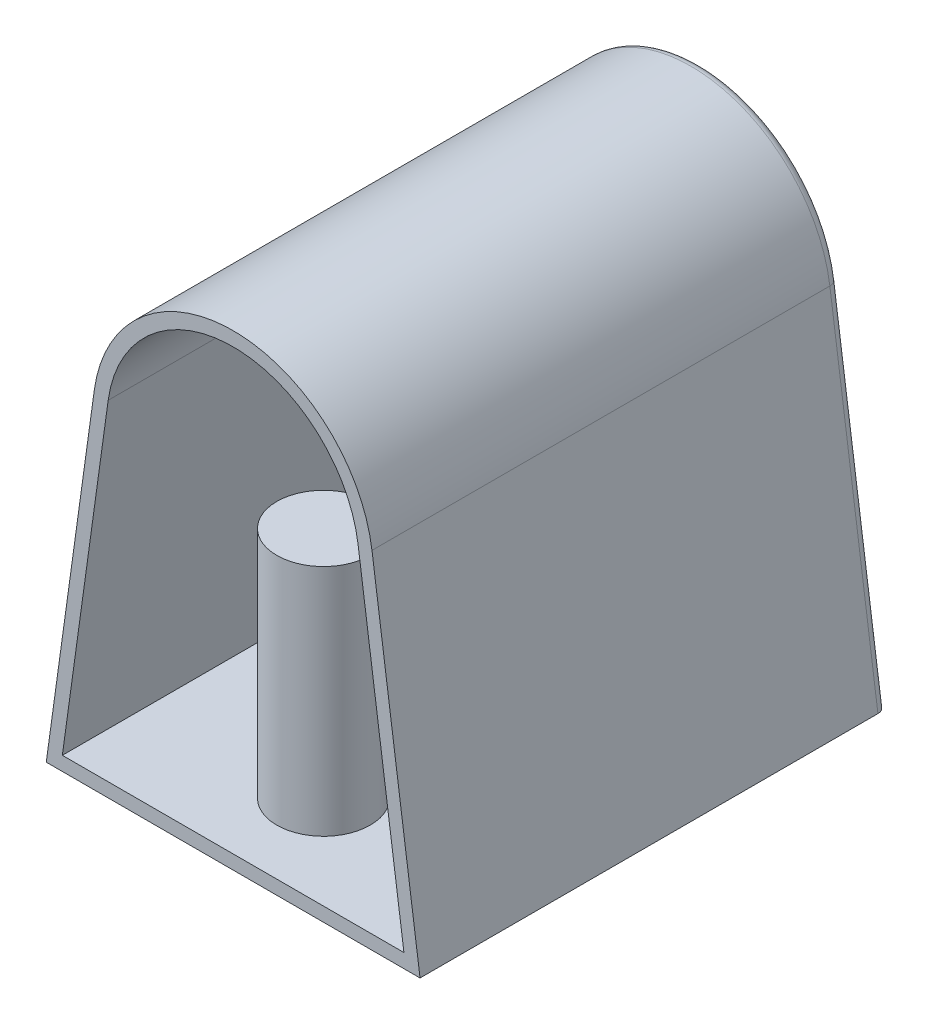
ISO-10303-21;
HEADER;
FILE_DESCRIPTION(('STEP AP214'),'2;1');
FILE_NAME('part.step','',(''),(''),'','','');
FILE_SCHEMA(('AUTOMOTIVE_DESIGN { 1 0 10303 214 1 1 1 1 }'));
ENDSEC;
DATA;
#1=APPLICATION_CONTEXT('core data for automotive mechanical design processes');
#2=APPLICATION_PROTOCOL_DEFINITION('international standard','automotive_design',2000,#1);
#3=PRODUCT_CONTEXT('',#1,'mechanical');
#4=PRODUCT('Part','Part','',(#3));
#5=PRODUCT_RELATED_PRODUCT_CATEGORY('part','',(#4));
#6=PRODUCT_DEFINITION_FORMATION('','',#4);
#7=PRODUCT_DEFINITION_CONTEXT('part definition',#1,'design');
#8=PRODUCT_DEFINITION('design','',#6,#7);
#9=PRODUCT_DEFINITION_SHAPE('','',#8);
#10=(LENGTH_UNIT() NAMED_UNIT(*) SI_UNIT(.MILLI.,.METRE.));
#11=(NAMED_UNIT(*) PLANE_ANGLE_UNIT() SI_UNIT($,.RADIAN.));
#12=(NAMED_UNIT(*) SI_UNIT($,.STERADIAN.) SOLID_ANGLE_UNIT());
#13=UNCERTAINTY_MEASURE_WITH_UNIT(LENGTH_MEASURE(1.E-05),#10,'distance_accuracy_value','');
#14=(GEOMETRIC_REPRESENTATION_CONTEXT(3) GLOBAL_UNCERTAINTY_ASSIGNED_CONTEXT((#13)) GLOBAL_UNIT_ASSIGNED_CONTEXT((#10,
#11,#12)) REPRESENTATION_CONTEXT('',''));
#15=CARTESIAN_POINT('',(0.,0.,0.));
#16=DIRECTION('',(0.,0.,1.));
#17=DIRECTION('',(1.,0.,0.));
#18=AXIS2_PLACEMENT_3D('',#15,#16,#17);
#19=CARTESIAN_POINT('',(140.,75.,150.));
#20=DIRECTION('',(0.,1.,0.));
#21=DIRECTION('',(0.,0.,1.));
#22=AXIS2_PLACEMENT_3D('',#19,#20,#21);
#23=PLANE('',#22);
#24=DIRECTION('',(1.,0.,0.));
#25=VECTOR('',#24,1.);
#26=CARTESIAN_POINT('',(140.,75.,150.));
#27=LINE('',#26,#25);
#28=CARTESIAN_POINT('',(-140.,75.,150.));
#29=VERTEX_POINT('',#28);
#30=CARTESIAN_POINT('',(-135.,75.,150.));
#31=VERTEX_POINT('',#30);
#32=EDGE_CURVE('E298',#29,#31,#27,.T.);
#33=ORIENTED_EDGE('',*,*,#32,.T.);
#34=DIRECTION('',(0.,0.,1.));
#35=VECTOR('',#34,1.);
#36=CARTESIAN_POINT('',(-135.,75.,15.9999999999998));
#37=LINE('',#36,#35);
#38=CARTESIAN_POINT('',(-135.,75.,111.));
#39=VERTEX_POINT('',#38);
#40=EDGE_CURVE('E308',#39,#31,#37,.T.);
#41=ORIENTED_EDGE('',*,*,#40,.F.);
#42=DIRECTION('',(-1.,0.,0.));
#43=VECTOR('',#42,1.);
#44=CARTESIAN_POINT('',(0.,75.,111.));
#45=LINE('',#44,#43);
#46=CARTESIAN_POINT('',(-140.,75.,111.));
#47=VERTEX_POINT('',#46);
#48=EDGE_CURVE('E568',#39,#47,#45,.T.);
#49=ORIENTED_EDGE('',*,*,#48,.T.);
#50=DIRECTION('',(0.,0.,-1.));
#51=VECTOR('',#50,1.);
#52=CARTESIAN_POINT('',(-140.,75.,150.));
#53=LINE('',#52,#51);
#54=EDGE_CURVE('E315',#29,#47,#53,.T.);
#55=ORIENTED_EDGE('',*,*,#54,.F.);
#56=EDGE_LOOP('',(#33,#41,#49,#55));
#57=FACE_BOUND('',#56,.T.);
#58=ADVANCED_FACE('F52',(#57),#23,.T.);
#59=CARTESIAN_POINT('',(135.,70.,-199.));
#60=DIRECTION('',(0.,1.,0.));
#61=DIRECTION('',(0.,0.,1.));
#62=AXIS2_PLACEMENT_3D('',#59,#60,#61);
#63=PLANE('',#62);
#64=DIRECTION('',(0.,0.,1.));
#65=VECTOR('',#64,1.);
#66=CARTESIAN_POINT('',(135.,70.,-199.));
#67=LINE('',#66,#65);
#68=CARTESIAN_POINT('',(135.,70.,0.));
#69=VERTEX_POINT('',#68);
#70=CARTESIAN_POINT('',(135.,70.,15.9999999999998));
#71=VERTEX_POINT('',#70);
#72=EDGE_CURVE('E587',#69,#71,#67,.T.);
#73=ORIENTED_EDGE('',*,*,#72,.T.);
#74=DIRECTION('',(-1.,0.,0.));
#75=VECTOR('',#74,1.);
#76=CARTESIAN_POINT('',(135.,70.,15.9999999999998));
#77=LINE('',#76,#75);
#78=CARTESIAN_POINT('',(-135.,70.,15.9999999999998));
#79=VERTEX_POINT('',#78);
#80=EDGE_CURVE('E60',#71,#79,#77,.T.);
#81=ORIENTED_EDGE('',*,*,#80,.T.);
#82=DIRECTION('',(0.,0.,1.));
#83=VECTOR('',#82,1.);
#84=CARTESIAN_POINT('',(-135.,70.,-199.));
#85=LINE('',#84,#83);
#86=CARTESIAN_POINT('',(-135.,70.,0.));
#87=VERTEX_POINT('',#86);
#88=EDGE_CURVE('E75',#87,#79,#85,.T.);
#89=ORIENTED_EDGE('',*,*,#88,.F.);
#90=DIRECTION('',(-1.,0.,0.));
#91=VECTOR('',#90,1.);
#92=CARTESIAN_POINT('',(0.,70.,0.));
#93=LINE('',#92,#91);
#94=EDGE_CURVE('E601',#69,#87,#93,.T.);
#95=ORIENTED_EDGE('',*,*,#94,.F.);
#96=EDGE_LOOP('',(#73,#81,#89,#95));
#97=FACE_BOUND('',#96,.T.);
#98=ADVANCED_FACE('F585',(#97),#63,.F.);
#99=CARTESIAN_POINT('',(0.,350.,0.));
#100=DIRECTION('',(0.,0.,1.));
#101=DIRECTION('',(1.,0.,0.));
#102=AXIS2_PLACEMENT_3D('',#99,#100,#101);
#103=PLANE('',#102);
#104=DIRECTION('',(1.,0.,0.));
#105=VECTOR('',#104,1.);
#106=CARTESIAN_POINT('',(0.,30.,0.));
#107=LINE('',#106,#105);
#108=CARTESIAN_POINT('',(-135.,30.,0.));
#109=VERTEX_POINT('',#108);
#110=CARTESIAN_POINT('',(135.,30.,0.));
#111=VERTEX_POINT('',#110);
#112=EDGE_CURVE('E604',#109,#111,#107,.T.);
#113=ORIENTED_EDGE('',*,*,#112,.T.);
#114=DIRECTION('',(0.,1.,0.));
#115=VECTOR('',#114,1.);
#116=CARTESIAN_POINT('',(135.,350.,0.));
#117=LINE('',#116,#115);
#118=EDGE_CURVE('E606',#111,#69,#117,.T.);
#119=ORIENTED_EDGE('',*,*,#118,.T.);
#120=ORIENTED_EDGE('',*,*,#94,.T.);
#121=DIRECTION('',(0.,-1.,0.));
#122=VECTOR('',#121,1.);
#123=CARTESIAN_POINT('',(-135.,350.,0.));
#124=LINE('',#123,#122);
#125=EDGE_CURVE('E592',#87,#109,#124,.T.);
#126=ORIENTED_EDGE('',*,*,#125,.T.);
#127=EDGE_LOOP('',(#113,#119,#120,#126));
#128=FACE_BOUND('',#127,.T.);
#129=CARTESIAN_POINT('',(0.462074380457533,202.5,0.));
#130=DIRECTION('',(0.,0.,1.));
#131=DIRECTION('',(1.,0.,0.));
#132=AXIS2_PLACEMENT_3D('',#129,#130,#131);
#133=CIRCLE('',#132,15.);
#134=CARTESIAN_POINT('',(15.4620743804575,202.5,0.));
#135=VERTEX_POINT('',#134);
#136=EDGE_CURVE('E536',#135,#135,#133,.F.);
#137=ORIENTED_EDGE('',*,*,#136,.F.);
#138=EDGE_LOOP('',(#137));
#139=FACE_BOUND('',#138,.T.);
#140=CARTESIAN_POINT('',(0.462074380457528,112.5,0.));
#141=DIRECTION('',(0.,0.,1.));
#142=DIRECTION('',(1.,0.,0.));
#143=AXIS2_PLACEMENT_3D('',#140,#141,#142);
#144=CIRCLE('',#143,15.);
#145=CARTESIAN_POINT('',(15.4620743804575,112.5,0.));
#146=VERTEX_POINT('',#145);
#147=EDGE_CURVE('E533',#146,#146,#144,.F.);
#148=ORIENTED_EDGE('',*,*,#147,.F.);
#149=EDGE_LOOP('',(#148));
#150=FACE_BOUND('',#149,.T.);
#151=CARTESIAN_POINT('',(45.4620743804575,157.5,0.));
#152=DIRECTION('',(0.,0.,1.));
#153=DIRECTION('',(1.,0.,0.));
#154=AXIS2_PLACEMENT_3D('',#151,#152,#153);
#155=CIRCLE('',#154,15.);
#156=CARTESIAN_POINT('',(60.4620743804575,157.5,0.));
#157=VERTEX_POINT('',#156);
#158=EDGE_CURVE('E530',#157,#157,#155,.F.);
#159=ORIENTED_EDGE('',*,*,#158,.F.);
#160=EDGE_LOOP('',(#159));
#161=FACE_BOUND('',#160,.T.);
#162=CARTESIAN_POINT('',(-44.5379256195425,157.5,0.));
#163=DIRECTION('',(0.,0.,1.));
#164=DIRECTION('',(1.,0.,0.));
#165=AXIS2_PLACEMENT_3D('',#162,#163,#164);
#166=CIRCLE('',#165,15.);
#167=CARTESIAN_POINT('',(-29.5379256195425,157.5,0.));
#168=VERTEX_POINT('',#167);
#169=EDGE_CURVE('E527',#168,#168,#166,.F.);
#170=ORIENTED_EDGE('',*,*,#169,.F.);
#171=EDGE_LOOP('',(#170));
#172=FACE_BOUND('',#171,.T.);
#173=CARTESIAN_POINT('',(0.462074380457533,157.5,0.));
#174=DIRECTION('',(0.,0.,1.));
#175=DIRECTION('',(1.,0.,0.));
#176=AXIS2_PLACEMENT_3D('',#173,#174,#175);
#177=CIRCLE('',#176,22.5);
#178=CARTESIAN_POINT('',(22.9620743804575,157.5,0.));
#179=VERTEX_POINT('',#178);
#180=EDGE_CURVE('E512',#179,#179,#177,.F.);
#181=ORIENTED_EDGE('',*,*,#180,.F.);
#182=EDGE_LOOP('',(#181));
#183=FACE_BOUND('',#182,.T.);
#184=DIRECTION('',(-1.,0.,0.));
#185=VECTOR('',#184,1.);
#186=CARTESIAN_POINT('',(-124.225243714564,340.,0.));
#187=LINE('',#186,#185);
#188=CARTESIAN_POINT('',(135.774756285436,340.,0.));
#189=VERTEX_POINT('',#188);
#190=CARTESIAN_POINT('',(-134.225243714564,340.,0.));
#191=VERTEX_POINT('',#190);
#192=EDGE_CURVE('E495',#189,#191,#187,.T.);
#193=ORIENTED_EDGE('',*,*,#192,.T.);
#194=DIRECTION('',(0.,-1.,0.));
#195=VECTOR('',#194,1.);
#196=CARTESIAN_POINT('',(-134.225243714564,230.,0.));
#197=LINE('',#196,#195);
#198=CARTESIAN_POINT('',(-134.225243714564,220.,0.));
#199=VERTEX_POINT('',#198);
#200=EDGE_CURVE('E497',#191,#199,#197,.T.);
#201=ORIENTED_EDGE('',*,*,#200,.T.);
#202=DIRECTION('',(1.,0.,0.));
#203=VECTOR('',#202,1.);
#204=CARTESIAN_POINT('',(125.774756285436,220.,0.));
#205=LINE('',#204,#203);
#206=CARTESIAN_POINT('',(135.774756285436,220.,0.));
#207=VERTEX_POINT('',#206);
#208=EDGE_CURVE('E493',#199,#207,#205,.T.);
#209=ORIENTED_EDGE('',*,*,#208,.T.);
#210=DIRECTION('',(0.,1.,0.));
#211=VECTOR('',#210,1.);
#212=CARTESIAN_POINT('',(135.774756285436,330.,0.));
#213=LINE('',#212,#211);
#214=EDGE_CURVE('E491',#207,#189,#213,.T.);
#215=ORIENTED_EDGE('',*,*,#214,.T.);
#216=EDGE_LOOP('',(#193,#201,#209,#215));
#217=FACE_BOUND('',#216,.T.);
#218=CARTESIAN_POINT('',(0.,350.,0.));
#219=DIRECTION('',(0.,0.,1.));
#220=DIRECTION('',(1.,0.,0.));
#221=AXIS2_PLACEMENT_3D('',#218,#219,#220);
#222=CIRCLE('',#221,140.);
#223=CARTESIAN_POINT('',(-138.671515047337,369.240865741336,0.));
#224=VERTEX_POINT('',#223);
#225=CARTESIAN_POINT('',(138.671515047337,369.240865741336,0.));
#226=VERTEX_POINT('',#225);
#227=EDGE_CURVE('E554',#224,#226,#222,.F.);
#228=ORIENTED_EDGE('',*,*,#227,.T.);
#229=DIRECTION('',(-0.137434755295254,0.990510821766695,0.));
#230=VECTOR('',#229,1.);
#231=CARTESIAN_POINT('',(138.671515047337,369.240865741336,0.));
#232=LINE('',#231,#230);
#233=CARTESIAN_POINT('',(189.904199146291,0.,0.));
#234=VERTEX_POINT('',#233);
#235=EDGE_CURVE('E558',#226,#234,#232,.F.);
#236=ORIENTED_EDGE('',*,*,#235,.T.);
#237=DIRECTION('',(1.,0.,0.));
#238=VECTOR('',#237,1.);
#239=CARTESIAN_POINT('',(0.,0.,0.));
#240=LINE('',#239,#238);
#241=CARTESIAN_POINT('',(-189.904199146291,0.,0.));
#242=VERTEX_POINT('',#241);
#243=EDGE_CURVE('E470',#242,#234,#240,.T.);
#244=ORIENTED_EDGE('',*,*,#243,.F.);
#245=DIRECTION('',(-0.137434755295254,-0.990510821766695,0.));
#246=VECTOR('',#245,1.);
#247=CARTESIAN_POINT('',(-138.671515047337,369.240865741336,0.));
#248=LINE('',#247,#246);
#249=EDGE_CURVE('E556',#242,#224,#248,.F.);
#250=ORIENTED_EDGE('',*,*,#249,.T.);
#251=EDGE_LOOP('',(#228,#236,#244,#250));
#252=FACE_BOUND('',#251,.T.);
#253=ADVANCED_FACE('F638',(#128,#139,#150,#161,#172,#183,#217,#252),#103,.F.);
#254=CARTESIAN_POINT('',(0.,0.,500.));
#255=DIRECTION('',(0.,1.,0.));
#256=DIRECTION('',(0.,0.,1.));
#257=AXIS2_PLACEMENT_3D('',#254,#255,#256);
#258=PLANE('',#257);
#259=ORIENTED_EDGE('',*,*,#243,.T.);
#260=CARTESIAN_POINT('',(189.904199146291,0.,10.));
#261=DIRECTION('',(0.,1.,0.));
#262=DIRECTION('',(-1.,0.,0.));
#263=AXIS2_PLACEMENT_3D('',#260,#261,#262);
#264=ELLIPSE('',#263,10.0958008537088,10.);
#265=CARTESIAN_POINT('',(200.,0.,10.));
#266=VERTEX_POINT('',#265);
#267=EDGE_CURVE('E562',#234,#266,#264,.F.);
#268=ORIENTED_EDGE('',*,*,#267,.T.);
#269=DIRECTION('',(0.,0.,-1.));
#270=VECTOR('',#269,1.);
#271=CARTESIAN_POINT('',(200.,0.,500.));
#272=LINE('',#271,#270);
#273=CARTESIAN_POINT('',(200.,0.,500.));
#274=VERTEX_POINT('',#273);
#275=EDGE_CURVE('E488',#274,#266,#272,.T.);
#276=ORIENTED_EDGE('',*,*,#275,.F.);
#277=DIRECTION('',(1.,0.,0.));
#278=VECTOR('',#277,1.);
#279=CARTESIAN_POINT('',(0.,0.,500.));
#280=LINE('',#279,#278);
#281=CARTESIAN_POINT('',(-200.,0.,500.));
#282=VERTEX_POINT('',#281);
#283=EDGE_CURVE('E467',#282,#274,#280,.T.);
#284=ORIENTED_EDGE('',*,*,#283,.F.);
#285=DIRECTION('',(0.,0.,-1.));
#286=VECTOR('',#285,1.);
#287=CARTESIAN_POINT('',(-200.,0.,500.));
#288=LINE('',#287,#286);
#289=CARTESIAN_POINT('',(-200.,0.,10.));
#290=VERTEX_POINT('',#289);
#291=EDGE_CURVE('E476',#282,#290,#288,.T.);
#292=ORIENTED_EDGE('',*,*,#291,.T.);
#293=CARTESIAN_POINT('',(-189.904199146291,0.,10.));
#294=DIRECTION('',(0.,1.,0.));
#295=DIRECTION('',(-1.,0.,0.));
#296=AXIS2_PLACEMENT_3D('',#293,#294,#295);
#297=ELLIPSE('',#296,10.0958008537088,10.);
#298=EDGE_CURVE('E560',#290,#242,#297,.F.);
#299=ORIENTED_EDGE('',*,*,#298,.T.);
#300=EDGE_LOOP('',(#259,#268,#276,#284,#292,#299));
#301=FACE_BOUND('',#300,.T.);
#302=ADVANCED_FACE('F821',(#301),#258,.F.);
#303=CARTESIAN_POINT('',(200.,0.,500.));
#304=DIRECTION('',(-0.990510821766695,-0.137434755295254,0.));
#305=DIRECTION('',(0.137434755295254,-0.990510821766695,0.));
#306=AXIS2_PLACEMENT_3D('',#303,#304,#305);
#307=PLANE('',#306);
#308=ORIENTED_EDGE('',*,*,#275,.T.);
#309=DIRECTION('',(-0.137434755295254,0.990510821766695,0.));
#310=VECTOR('',#309,1.);
#311=CARTESIAN_POINT('',(200.,0.,10.));
#312=LINE('',#311,#310);
#313=CARTESIAN_POINT('',(148.576623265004,370.615213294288,10.));
#314=VERTEX_POINT('',#313);
#315=EDGE_CURVE('E551',#266,#314,#312,.T.);
#316=ORIENTED_EDGE('',*,*,#315,.T.);
#317=DIRECTION('',(0.,0.,-1.));
#318=VECTOR('',#317,1.);
#319=CARTESIAN_POINT('',(148.576623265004,370.615213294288,500.));
#320=LINE('',#319,#318);
#321=CARTESIAN_POINT('',(148.576623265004,370.615213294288,500.));
#322=VERTEX_POINT('',#321);
#323=EDGE_CURVE('E485',#322,#314,#320,.T.);
#324=ORIENTED_EDGE('',*,*,#323,.F.);
#325=DIRECTION('',(-0.137434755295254,0.990510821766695,0.));
#326=VECTOR('',#325,1.);
#327=CARTESIAN_POINT('',(200.,0.,500.));
#328=LINE('',#327,#326);
#329=EDGE_CURVE('E469',#274,#322,#328,.T.);
#330=ORIENTED_EDGE('',*,*,#329,.F.);
#331=EDGE_LOOP('',(#308,#316,#324,#330));
#332=FACE_BOUND('',#331,.T.);
#333=ADVANCED_FACE('F833',(#332),#307,.F.);
#334=CARTESIAN_POINT('',(0.,350.,500.));
#335=DIRECTION('',(0.,0.,-1.));
#336=DIRECTION('',(-1.,0.,0.));
#337=AXIS2_PLACEMENT_3D('',#334,#335,#336);
#338=CYLINDRICAL_SURFACE('',#337,150.);
#339=ORIENTED_EDGE('',*,*,#323,.T.);
#340=CARTESIAN_POINT('',(0.,350.,10.));
#341=DIRECTION('',(0.,0.,1.));
#342=DIRECTION('',(1.,0.,0.));
#343=AXIS2_PLACEMENT_3D('',#340,#341,#342);
#344=CIRCLE('',#343,150.);
#345=CARTESIAN_POINT('',(-148.576623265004,370.615213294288,10.));
#346=VERTEX_POINT('',#345);
#347=EDGE_CURVE('E566',#314,#346,#344,.T.);
#348=ORIENTED_EDGE('',*,*,#347,.T.);
#349=DIRECTION('',(0.,0.,-1.));
#350=VECTOR('',#349,1.);
#351=CARTESIAN_POINT('',(-148.576623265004,370.615213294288,500.));
#352=LINE('',#351,#350);
#353=CARTESIAN_POINT('',(-148.576623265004,370.615213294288,500.));
#354=VERTEX_POINT('',#353);
#355=EDGE_CURVE('E482',#354,#346,#352,.T.);
#356=ORIENTED_EDGE('',*,*,#355,.F.);
#357=CARTESIAN_POINT('',(0.,350.,500.));
#358=DIRECTION('',(0.,0.,1.));
#359=DIRECTION('',(1.,0.,0.));
#360=AXIS2_PLACEMENT_3D('',#357,#358,#359);
#361=CIRCLE('',#360,150.);
#362=EDGE_CURVE('E472',#322,#354,#361,.T.);
#363=ORIENTED_EDGE('',*,*,#362,.F.);
#364=EDGE_LOOP('',(#339,#348,#356,#363));
#365=FACE_BOUND('',#364,.T.);
#366=ADVANCED_FACE('F842',(#365),#338,.T.);
#367=CARTESIAN_POINT('',(-200.,0.,500.));
#368=DIRECTION('',(0.990510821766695,-0.137434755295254,0.));
#369=DIRECTION('',(0.137434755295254,0.990510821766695,0.));
#370=AXIS2_PLACEMENT_3D('',#367,#368,#369);
#371=PLANE('',#370);
#372=ORIENTED_EDGE('',*,*,#355,.T.);
#373=DIRECTION('',(-0.137434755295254,-0.990510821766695,0.));
#374=VECTOR('',#373,1.);
#375=CARTESIAN_POINT('',(-200.,0.,10.));
#376=LINE('',#375,#374);
#377=EDGE_CURVE('E564',#346,#290,#376,.T.);
#378=ORIENTED_EDGE('',*,*,#377,.T.);
#379=ORIENTED_EDGE('',*,*,#291,.F.);
#380=DIRECTION('',(-0.137434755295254,-0.990510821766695,0.));
#381=VECTOR('',#380,1.);
#382=CARTESIAN_POINT('',(-200.,0.,500.));
#383=LINE('',#382,#381);
#384=EDGE_CURVE('E474',#354,#282,#383,.T.);
#385=ORIENTED_EDGE('',*,*,#384,.F.);
#386=EDGE_LOOP('',(#372,#378,#379,#385));
#387=FACE_BOUND('',#386,.T.);
#388=ADVANCED_FACE('F850',(#387),#371,.F.);
#389=CARTESIAN_POINT('',(0.,350.,500.));
#390=DIRECTION('',(0.,0.,1.));
#391=DIRECTION('',(1.,0.,0.));
#392=AXIS2_PLACEMENT_3D('',#389,#390,#391);
#393=PLANE('',#392);
#394=DIRECTION('',(-0.137434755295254,0.990510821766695,0.));
#395=VECTOR('',#394,1.);
#396=CARTESIAN_POINT('',(182.775027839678,15.,500.));
#397=LINE('',#396,#395);
#398=CARTESIAN_POINT('',(182.775027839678,15.,500.));
#399=VERTEX_POINT('',#398);
#400=CARTESIAN_POINT('',(133.718960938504,368.553691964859,500.));
#401=VERTEX_POINT('',#400);
#402=EDGE_CURVE('E331',#399,#401,#397,.T.);
#403=ORIENTED_EDGE('',*,*,#402,.F.);
#404=DIRECTION('',(1.,0.,0.));
#405=VECTOR('',#404,1.);
#406=CARTESIAN_POINT('',(-182.775027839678,15.,500.));
#407=LINE('',#406,#405);
#408=CARTESIAN_POINT('',(-182.775027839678,15.,500.));
#409=VERTEX_POINT('',#408);
#410=EDGE_CURVE('E343',#409,#399,#407,.T.);
#411=ORIENTED_EDGE('',*,*,#410,.F.);
#412=DIRECTION('',(-0.137434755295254,-0.990510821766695,0.));
#413=VECTOR('',#412,1.);
#414=CARTESIAN_POINT('',(-133.718960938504,368.553691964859,500.));
#415=LINE('',#414,#413);
#416=CARTESIAN_POINT('',(-133.718960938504,368.553691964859,500.));
#417=VERTEX_POINT('',#416);
#418=EDGE_CURVE('E357',#417,#409,#415,.T.);
#419=ORIENTED_EDGE('',*,*,#418,.F.);
#420=CARTESIAN_POINT('',(0.,350.,500.));
#421=DIRECTION('',(0.,0.,1.));
#422=DIRECTION('',(1.,0.,0.));
#423=AXIS2_PLACEMENT_3D('',#420,#421,#422);
#424=CIRCLE('',#423,135.);
#425=EDGE_CURVE('E354',#401,#417,#424,.T.);
#426=ORIENTED_EDGE('',*,*,#425,.F.);
#427=EDGE_LOOP('',(#403,#411,#419,#426));
#428=FACE_BOUND('',#427,.T.);
#429=ORIENTED_EDGE('',*,*,#283,.T.);
#430=ORIENTED_EDGE('',*,*,#329,.T.);
#431=ORIENTED_EDGE('',*,*,#362,.T.);
#432=ORIENTED_EDGE('',*,*,#384,.T.);
#433=EDGE_LOOP('',(#429,#430,#431,#432));
#434=FACE_BOUND('',#433,.T.);
#435=ADVANCED_FACE('F671',(#428,#434),#393,.T.);
#436=CARTESIAN_POINT('',(135.774756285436,350.,10.));
#437=DIRECTION('',(0.,-1.,0.));
#438=DIRECTION('',(0.,0.,-1.));
#439=AXIS2_PLACEMENT_3D('',#436,#437,#438);
#440=CYLINDRICAL_SURFACE('',#439,10.);
#441=CARTESIAN_POINT('',(135.774756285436,220.,10.));
#442=DIRECTION('',(-0.707106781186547,-0.707106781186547,0.));
#443=DIRECTION('',(-0.707106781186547,0.707106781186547,0.));
#444=AXIS2_PLACEMENT_3D('',#441,#442,#443);
#445=ELLIPSE('',#444,14.1421356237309,10.);
#446=CARTESIAN_POINT('',(125.774756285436,230.,10.));
#447=VERTEX_POINT('',#446);
#448=EDGE_CURVE('E517',#447,#207,#445,.T.);
#449=ORIENTED_EDGE('',*,*,#448,.F.);
#450=DIRECTION('',(0.,1.,0.));
#451=VECTOR('',#450,1.);
#452=CARTESIAN_POINT('',(125.774756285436,230.,10.));
#453=LINE('',#452,#451);
#454=CARTESIAN_POINT('',(125.774756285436,330.,10.));
#455=VERTEX_POINT('',#454);
#456=EDGE_CURVE('E509',#455,#447,#453,.F.);
#457=ORIENTED_EDGE('',*,*,#456,.F.);
#458=CARTESIAN_POINT('',(135.774756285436,340.,10.));
#459=DIRECTION('',(0.707106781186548,-0.707106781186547,0.));
#460=DIRECTION('',(0.707106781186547,0.707106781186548,0.));
#461=AXIS2_PLACEMENT_3D('',#458,#459,#460);
#462=ELLIPSE('',#461,14.142135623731,10.);
#463=EDGE_CURVE('E479',#189,#455,#462,.F.);
#464=ORIENTED_EDGE('',*,*,#463,.F.);
#465=ORIENTED_EDGE('',*,*,#214,.F.);
#466=EDGE_LOOP('',(#449,#457,#464,#465));
#467=FACE_BOUND('',#466,.T.);
#468=ADVANCED_FACE('F866',(#467),#440,.T.);
#469=CARTESIAN_POINT('',(0.,340.,10.));
#470=DIRECTION('',(1.,0.,0.));
#471=DIRECTION('',(0.,1.,0.));
#472=AXIS2_PLACEMENT_3D('',#469,#470,#471);
#473=CYLINDRICAL_SURFACE('',#472,10.);
#474=ORIENTED_EDGE('',*,*,#463,.T.);
#475=DIRECTION('',(-1.,0.,0.));
#476=VECTOR('',#475,1.);
#477=CARTESIAN_POINT('',(125.774756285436,330.,10.));
#478=LINE('',#477,#476);
#479=CARTESIAN_POINT('',(-124.225243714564,330.,10.));
#480=VERTEX_POINT('',#479);
#481=EDGE_CURVE('E503',#480,#455,#478,.F.);
#482=ORIENTED_EDGE('',*,*,#481,.F.);
#483=CARTESIAN_POINT('',(-134.225243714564,340.,10.));
#484=DIRECTION('',(0.707106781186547,0.707106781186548,0.));
#485=DIRECTION('',(-0.707106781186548,0.707106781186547,0.));
#486=AXIS2_PLACEMENT_3D('',#483,#484,#485);
#487=ELLIPSE('',#486,14.1421356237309,10.);
#488=EDGE_CURVE('E514',#191,#480,#487,.F.);
#489=ORIENTED_EDGE('',*,*,#488,.F.);
#490=ORIENTED_EDGE('',*,*,#192,.F.);
#491=EDGE_LOOP('',(#474,#482,#489,#490));
#492=FACE_BOUND('',#491,.T.);
#493=ADVANCED_FACE('F875',(#492),#473,.T.);
#494=CARTESIAN_POINT('',(0.,220.,10.));
#495=DIRECTION('',(-1.,0.,0.));
#496=DIRECTION('',(0.,0.,1.));
#497=AXIS2_PLACEMENT_3D('',#494,#495,#496);
#498=CYLINDRICAL_SURFACE('',#497,10.);
#499=ORIENTED_EDGE('',*,*,#448,.T.);
#500=ORIENTED_EDGE('',*,*,#208,.F.);
#501=CARTESIAN_POINT('',(-134.225243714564,220.,10.));
#502=DIRECTION('',(-0.707106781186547,0.707106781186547,0.));
#503=DIRECTION('',(0.707106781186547,0.707106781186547,0.));
#504=AXIS2_PLACEMENT_3D('',#501,#502,#503);
#505=ELLIPSE('',#504,14.1421356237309,10.);
#506=CARTESIAN_POINT('',(-124.225243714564,230.,10.));
#507=VERTEX_POINT('',#506);
#508=EDGE_CURVE('E466',#507,#199,#505,.T.);
#509=ORIENTED_EDGE('',*,*,#508,.F.);
#510=DIRECTION('',(1.,0.,0.));
#511=VECTOR('',#510,1.);
#512=CARTESIAN_POINT('',(-124.225243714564,230.,10.));
#513=LINE('',#512,#511);
#514=EDGE_CURVE('E506',#447,#507,#513,.F.);
#515=ORIENTED_EDGE('',*,*,#514,.F.);
#516=EDGE_LOOP('',(#499,#500,#509,#515));
#517=FACE_BOUND('',#516,.T.);
#518=ADVANCED_FACE('F883',(#517),#498,.T.);
#519=CARTESIAN_POINT('',(-134.225243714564,350.,10.));
#520=DIRECTION('',(0.,1.,0.));
#521=DIRECTION('',(0.,0.,1.));
#522=AXIS2_PLACEMENT_3D('',#519,#520,#521);
#523=CYLINDRICAL_SURFACE('',#522,10.);
#524=ORIENTED_EDGE('',*,*,#488,.T.);
#525=DIRECTION('',(0.,-1.,0.));
#526=VECTOR('',#525,1.);
#527=CARTESIAN_POINT('',(-124.225243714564,330.,10.));
#528=LINE('',#527,#526);
#529=EDGE_CURVE('E500',#507,#480,#528,.F.);
#530=ORIENTED_EDGE('',*,*,#529,.F.);
#531=ORIENTED_EDGE('',*,*,#508,.T.);
#532=ORIENTED_EDGE('',*,*,#200,.F.);
#533=EDGE_LOOP('',(#524,#530,#531,#532));
#534=FACE_BOUND('',#533,.T.);
#535=ADVANCED_FACE('F891',(#534),#523,.T.);
#536=CARTESIAN_POINT('',(0.,0.,10.));
#537=DIRECTION('',(0.,0.,-1.));
#538=DIRECTION('',(-1.,0.,0.));
#539=AXIS2_PLACEMENT_3D('',#536,#537,#538);
#540=PLANE('',#539);
#541=ORIENTED_EDGE('',*,*,#481,.T.);
#542=ORIENTED_EDGE('',*,*,#456,.T.);
#543=ORIENTED_EDGE('',*,*,#514,.T.);
#544=ORIENTED_EDGE('',*,*,#529,.T.);
#545=EDGE_LOOP('',(#541,#542,#543,#544));
#546=FACE_BOUND('',#545,.T.);
#547=ADVANCED_FACE('F899',(#546),#540,.T.);
#548=CARTESIAN_POINT('',(0.462074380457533,157.5,-5.));
#549=DIRECTION('',(0.,0.,-1.));
#550=DIRECTION('',(-1.,0.,0.));
#551=AXIS2_PLACEMENT_3D('',#548,#549,#550);
#552=PLANE('',#551);
#553=CARTESIAN_POINT('',(0.462074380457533,157.5,-5.));
#554=DIRECTION('',(0.,0.,-1.));
#555=DIRECTION('',(-1.,0.,0.));
#556=AXIS2_PLACEMENT_3D('',#553,#554,#555);
#557=CIRCLE('',#556,17.5);
#558=CARTESIAN_POINT('',(-17.0379256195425,157.5,-5.));
#559=VERTEX_POINT('',#558);
#560=EDGE_CURVE('E524',#559,#559,#557,.T.);
#561=ORIENTED_EDGE('',*,*,#560,.T.);
#562=EDGE_LOOP('',(#561));
#563=FACE_BOUND('',#562,.T.);
#564=ADVANCED_FACE('F908',(#563),#552,.T.);
#565=CARTESIAN_POINT('',(0.462074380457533,157.5,0.));
#566=DIRECTION('',(0.,0.,-1.));
#567=DIRECTION('',(-1.,0.,0.));
#568=AXIS2_PLACEMENT_3D('',#565,#566,#567);
#569=TOROIDAL_SURFACE('',#568,17.5,5.);
#570=ORIENTED_EDGE('',*,*,#180,.T.);
#571=EDGE_LOOP('',(#570));
#572=FACE_BOUND('',#571,.T.);
#573=ORIENTED_EDGE('',*,*,#560,.F.);
#574=EDGE_LOOP('',(#573));
#575=FACE_BOUND('',#574,.T.);
#576=ADVANCED_FACE('F916',(#572,#575),#569,.T.);
#577=CARTESIAN_POINT('',(-44.5379256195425,157.5,-5.));
#578=DIRECTION('',(0.,0.,-1.));
#579=DIRECTION('',(-1.,0.,0.));
#580=AXIS2_PLACEMENT_3D('',#577,#578,#579);
#581=PLANE('',#580);
#582=DIRECTION('',(0.911921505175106,-0.410364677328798,0.));
#583=VECTOR('',#582,1.);
#584=CARTESIAN_POINT('',(50.5975634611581,112.439029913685,-5.));
#585=LINE('',#584,#583);
#586=CARTESIAN_POINT('',(-49.5379256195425,157.5,-5.));
#587=VERTEX_POINT('',#586);
#588=CARTESIAN_POINT('',(-39.5379256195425,153.,-5.));
#589=VERTEX_POINT('',#588);
#590=EDGE_CURVE('E418',#587,#589,#585,.T.);
#591=ORIENTED_EDGE('',*,*,#590,.T.);
#592=DIRECTION('',(0.,1.,0.));
#593=VECTOR('',#592,1.);
#594=CARTESIAN_POINT('',(-39.5379256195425,0.,-5.));
#595=LINE('',#594,#593);
#596=CARTESIAN_POINT('',(-39.5379256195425,162.,-5.));
#597=VERTEX_POINT('',#596);
#598=EDGE_CURVE('E423',#589,#597,#595,.T.);
#599=ORIENTED_EDGE('',*,*,#598,.T.);
#600=DIRECTION('',(-0.911921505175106,-0.410364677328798,0.));
#601=VECTOR('',#600,1.);
#602=CARTESIAN_POINT('',(-67.2818544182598,149.515232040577,-5.));
#603=LINE('',#602,#601);
#604=EDGE_CURVE('E431',#597,#587,#603,.T.);
#605=ORIENTED_EDGE('',*,*,#604,.T.);
#606=EDGE_LOOP('',(#591,#599,#605));
#607=FACE_BOUND('',#606,.T.);
#608=CARTESIAN_POINT('',(-44.5379256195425,157.5,-5.));
#609=DIRECTION('',(0.,0.,-1.));
#610=DIRECTION('',(-1.,0.,0.));
#611=AXIS2_PLACEMENT_3D('',#608,#609,#610);
#612=CIRCLE('',#611,10.);
#613=CARTESIAN_POINT('',(-54.5379256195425,157.5,-5.));
#614=VERTEX_POINT('',#613);
#615=EDGE_CURVE('E539',#614,#614,#612,.T.);
#616=ORIENTED_EDGE('',*,*,#615,.T.);
#617=EDGE_LOOP('',(#616));
#618=FACE_BOUND('',#617,.T.);
#619=ADVANCED_FACE('F924',(#607,#618),#581,.T.);
#620=CARTESIAN_POINT('',(45.4620743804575,157.5,-5.));
#621=DIRECTION('',(0.,0.,-1.));
#622=DIRECTION('',(-1.,0.,0.));
#623=AXIS2_PLACEMENT_3D('',#620,#621,#622);
#624=PLANE('',#623);
#625=DIRECTION('',(-0.914861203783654,0.403768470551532,0.));
#626=VECTOR('',#625,1.);
#627=CARTESIAN_POINT('',(66.4380122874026,150.5356765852,-5.));
#628=LINE('',#627,#626);
#629=CARTESIAN_POINT('',(50.6582033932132,157.5,-5.));
#630=VERTEX_POINT('',#629);
#631=CARTESIAN_POINT('',(40.4620743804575,162.,-5.));
#632=VERTEX_POINT('',#631);
#633=EDGE_CURVE('E380',#630,#632,#628,.T.);
#634=ORIENTED_EDGE('',*,*,#633,.T.);
#635=DIRECTION('',(0.,1.,0.));
#636=VECTOR('',#635,1.);
#637=CARTESIAN_POINT('',(40.4620743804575,0.,-5.));
#638=LINE('',#637,#636);
#639=CARTESIAN_POINT('',(40.4620743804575,153.,-5.));
#640=VERTEX_POINT('',#639);
#641=EDGE_CURVE('E375',#640,#632,#638,.T.);
#642=ORIENTED_EDGE('',*,*,#641,.F.);
#643=DIRECTION('',(-0.914861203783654,-0.403768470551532,0.));
#644=VECTOR('',#643,1.);
#645=CARTESIAN_POINT('',(-49.9205020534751,113.11019540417,-5.));
#646=LINE('',#645,#644);
#647=EDGE_CURVE('E383',#630,#640,#646,.T.);
#648=ORIENTED_EDGE('',*,*,#647,.F.);
#649=EDGE_LOOP('',(#634,#642,#648));
#650=FACE_BOUND('',#649,.T.);
#651=CARTESIAN_POINT('',(45.4620743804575,157.5,-5.));
#652=DIRECTION('',(0.,0.,-1.));
#653=DIRECTION('',(-1.,0.,0.));
#654=AXIS2_PLACEMENT_3D('',#651,#652,#653);
#655=CIRCLE('',#654,10.);
#656=CARTESIAN_POINT('',(35.4620743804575,157.5,-5.));
#657=VERTEX_POINT('',#656);
#658=EDGE_CURVE('E542',#657,#657,#655,.T.);
#659=ORIENTED_EDGE('',*,*,#658,.T.);
#660=EDGE_LOOP('',(#659));
#661=FACE_BOUND('',#660,.T.);
#662=ADVANCED_FACE('F932',(#650,#661),#624,.T.);
#663=CARTESIAN_POINT('',(0.462074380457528,112.5,-5.));
#664=DIRECTION('',(0.,0.,-1.));
#665=DIRECTION('',(-1.,0.,0.));
#666=AXIS2_PLACEMENT_3D('',#663,#664,#665);
#667=PLANE('',#666);
#668=DIRECTION('',(0.410364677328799,0.911921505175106,0.));
#669=VECTOR('',#668,1.);
#670=CARTESIAN_POINT('',(-39.8444287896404,17.9299929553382,-5.));
#671=LINE('',#670,#669);
#672=CARTESIAN_POINT('',(0.462074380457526,107.5,-5.));
#673=VERTEX_POINT('',#672);
#674=CARTESIAN_POINT('',(4.96207438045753,117.5,-5.));
#675=VERTEX_POINT('',#674);
#676=EDGE_CURVE('E442',#673,#675,#671,.T.);
#677=ORIENTED_EDGE('',*,*,#676,.T.);
#678=DIRECTION('',(-1.,0.,0.));
#679=VECTOR('',#678,1.);
#680=CARTESIAN_POINT('',(0.,117.5,-5.));
#681=LINE('',#680,#679);
#682=CARTESIAN_POINT('',(-4.53792561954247,117.5,-5.));
#683=VERTEX_POINT('',#682);
#684=EDGE_CURVE('E447',#675,#683,#681,.T.);
#685=ORIENTED_EDGE('',*,*,#684,.T.);
#686=DIRECTION('',(-0.447213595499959,0.894427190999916,0.));
#687=VECTOR('',#686,1.);
#688=CARTESIAN_POINT('',(43.3696595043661,21.6848297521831,-5.));
#689=LINE('',#688,#687);
#690=EDGE_CURVE('E454',#673,#683,#689,.T.);
#691=ORIENTED_EDGE('',*,*,#690,.F.);
#692=EDGE_LOOP('',(#677,#685,#691));
#693=FACE_BOUND('',#692,.T.);
#694=CARTESIAN_POINT('',(0.462074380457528,112.5,-5.));
#695=DIRECTION('',(0.,0.,-1.));
#696=DIRECTION('',(-1.,0.,0.));
#697=AXIS2_PLACEMENT_3D('',#694,#695,#696);
#698=CIRCLE('',#697,10.);
#699=CARTESIAN_POINT('',(-9.53792561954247,112.5,-5.));
#700=VERTEX_POINT('',#699);
#701=EDGE_CURVE('E545',#700,#700,#698,.T.);
#702=ORIENTED_EDGE('',*,*,#701,.T.);
#703=EDGE_LOOP('',(#702));
#704=FACE_BOUND('',#703,.T.);
#705=ADVANCED_FACE('F941',(#693,#704),#667,.T.);
#706=CARTESIAN_POINT('',(0.462074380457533,202.5,-5.));
#707=DIRECTION('',(0.,0.,-1.));
#708=DIRECTION('',(-1.,0.,0.));
#709=AXIS2_PLACEMENT_3D('',#706,#707,#708);
#710=PLANE('',#709);
#711=DIRECTION('',(-0.410364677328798,-0.911921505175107,0.));
#712=VECTOR('',#711,1.);
#713=CARTESIAN_POINT('',(-77.2664662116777,34.7699097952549,-5.));
#714=LINE('',#713,#712);
#715=CARTESIAN_POINT('',(0.462074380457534,207.5,-5.));
#716=VERTEX_POINT('',#715);
#717=CARTESIAN_POINT('',(-4.03792561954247,197.5,-5.));
#718=VERTEX_POINT('',#717);
#719=EDGE_CURVE('E394',#716,#718,#714,.T.);
#720=ORIENTED_EDGE('',*,*,#719,.T.);
#721=DIRECTION('',(1.,0.,0.));
#722=VECTOR('',#721,1.);
#723=CARTESIAN_POINT('',(0.,197.5,-5.));
#724=LINE('',#723,#722);
#725=CARTESIAN_POINT('',(4.96207438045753,197.5,-5.));
#726=VERTEX_POINT('',#725);
#727=EDGE_CURVE('E399',#718,#726,#724,.T.);
#728=ORIENTED_EDGE('',*,*,#727,.T.);
#729=DIRECTION('',(-0.410364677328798,0.911921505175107,0.));
#730=VECTOR('',#729,1.);
#731=CARTESIAN_POINT('',(78.0349890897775,35.1157450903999,-5.));
#732=LINE('',#731,#730);
#733=EDGE_CURVE('E407',#726,#716,#732,.T.);
#734=ORIENTED_EDGE('',*,*,#733,.T.);
#735=EDGE_LOOP('',(#720,#728,#734));
#736=FACE_BOUND('',#735,.T.);
#737=CARTESIAN_POINT('',(0.462074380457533,202.5,-5.));
#738=DIRECTION('',(0.,0.,-1.));
#739=DIRECTION('',(-1.,0.,0.));
#740=AXIS2_PLACEMENT_3D('',#737,#738,#739);
#741=CIRCLE('',#740,10.);
#742=CARTESIAN_POINT('',(-9.53792561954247,202.5,-5.));
#743=VERTEX_POINT('',#742);
#744=EDGE_CURVE('E548',#743,#743,#741,.T.);
#745=ORIENTED_EDGE('',*,*,#744,.T.);
#746=EDGE_LOOP('',(#745));
#747=FACE_BOUND('',#746,.T.);
#748=ADVANCED_FACE('F949',(#736,#747),#710,.T.);
#749=CARTESIAN_POINT('',(-44.5379256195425,157.5,0.));
#750=DIRECTION('',(0.,0.,-1.));
#751=DIRECTION('',(-1.,0.,0.));
#752=AXIS2_PLACEMENT_3D('',#749,#750,#751);
#753=TOROIDAL_SURFACE('',#752,10.,5.);
#754=ORIENTED_EDGE('',*,*,#169,.T.);
#755=EDGE_LOOP('',(#754));
#756=FACE_BOUND('',#755,.T.);
#757=ORIENTED_EDGE('',*,*,#615,.F.);
#758=EDGE_LOOP('',(#757));
#759=FACE_BOUND('',#758,.T.);
#760=ADVANCED_FACE('F957',(#756,#759),#753,.T.);
#761=CARTESIAN_POINT('',(45.4620743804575,157.5,0.));
#762=DIRECTION('',(0.,0.,-1.));
#763=DIRECTION('',(-1.,0.,0.));
#764=AXIS2_PLACEMENT_3D('',#761,#762,#763);
#765=TOROIDAL_SURFACE('',#764,10.,5.);
#766=ORIENTED_EDGE('',*,*,#158,.T.);
#767=EDGE_LOOP('',(#766));
#768=FACE_BOUND('',#767,.T.);
#769=ORIENTED_EDGE('',*,*,#658,.F.);
#770=EDGE_LOOP('',(#769));
#771=FACE_BOUND('',#770,.T.);
#772=ADVANCED_FACE('F965',(#768,#771),#765,.T.);
#773=CARTESIAN_POINT('',(0.462074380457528,112.5,0.));
#774=DIRECTION('',(0.,0.,-1.));
#775=DIRECTION('',(-1.,0.,0.));
#776=AXIS2_PLACEMENT_3D('',#773,#774,#775);
#777=TOROIDAL_SURFACE('',#776,10.,5.);
#778=ORIENTED_EDGE('',*,*,#147,.T.);
#779=EDGE_LOOP('',(#778));
#780=FACE_BOUND('',#779,.T.);
#781=ORIENTED_EDGE('',*,*,#701,.F.);
#782=EDGE_LOOP('',(#781));
#783=FACE_BOUND('',#782,.T.);
#784=ADVANCED_FACE('F973',(#780,#783),#777,.T.);
#785=CARTESIAN_POINT('',(0.462074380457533,202.5,0.));
#786=DIRECTION('',(0.,0.,-1.));
#787=DIRECTION('',(-1.,0.,0.));
#788=AXIS2_PLACEMENT_3D('',#785,#786,#787);
#789=TOROIDAL_SURFACE('',#788,10.,5.);
#790=ORIENTED_EDGE('',*,*,#136,.T.);
#791=EDGE_LOOP('',(#790));
#792=FACE_BOUND('',#791,.T.);
#793=ORIENTED_EDGE('',*,*,#744,.F.);
#794=EDGE_LOOP('',(#793));
#795=FACE_BOUND('',#794,.T.);
#796=ADVANCED_FACE('F981',(#792,#795),#789,.T.);
#797=CARTESIAN_POINT('',(-39.8444287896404,17.9299929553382,-6.));
#798=DIRECTION('',(0.911921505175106,-0.410364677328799,0.));
#799=DIRECTION('',(0.410364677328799,0.911921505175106,0.));
#800=AXIS2_PLACEMENT_3D('',#797,#798,#799);
#801=PLANE('',#800);
#802=ORIENTED_EDGE('',*,*,#676,.F.);
#803=DIRECTION('',(0.,0.,1.));
#804=VECTOR('',#803,1.);
#805=CARTESIAN_POINT('',(0.462074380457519,107.5,-6.));
#806=LINE('',#805,#804);
#807=CARTESIAN_POINT('',(0.462074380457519,107.5,-6.));
#808=VERTEX_POINT('',#807);
#809=EDGE_CURVE('E463',#808,#673,#806,.T.);
#810=ORIENTED_EDGE('',*,*,#809,.F.);
#811=DIRECTION('',(0.410364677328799,0.911921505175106,0.));
#812=VECTOR('',#811,1.);
#813=CARTESIAN_POINT('',(-39.8444287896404,17.9299929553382,-6.));
#814=LINE('',#813,#812);
#815=CARTESIAN_POINT('',(4.96207438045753,117.5,-6.));
#816=VERTEX_POINT('',#815);
#817=EDGE_CURVE('E443',#808,#816,#814,.T.);
#818=ORIENTED_EDGE('',*,*,#817,.T.);
#819=DIRECTION('',(0.,0.,1.));
#820=VECTOR('',#819,1.);
#821=CARTESIAN_POINT('',(4.96207438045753,117.5,-6.));
#822=LINE('',#821,#820);
#823=EDGE_CURVE('E452',#816,#675,#822,.T.);
#824=ORIENTED_EDGE('',*,*,#823,.T.);
#825=EDGE_LOOP('',(#802,#810,#818,#824));
#826=FACE_BOUND('',#825,.T.);
#827=ADVANCED_FACE('F989',(#826),#801,.T.);
#828=CARTESIAN_POINT('',(43.3696595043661,21.6848297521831,-6.));
#829=DIRECTION('',(0.894427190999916,0.447213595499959,0.));
#830=DIRECTION('',(-0.447213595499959,0.894427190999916,0.));
#831=AXIS2_PLACEMENT_3D('',#828,#829,#830);
#832=PLANE('',#831);
#833=ORIENTED_EDGE('',*,*,#690,.T.);
#834=DIRECTION('',(0.,0.,1.));
#835=VECTOR('',#834,1.);
#836=CARTESIAN_POINT('',(-4.53792561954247,117.5,-6.));
#837=LINE('',#836,#835);
#838=CARTESIAN_POINT('',(-4.53792561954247,117.5,-6.));
#839=VERTEX_POINT('',#838);
#840=EDGE_CURVE('E460',#839,#683,#837,.T.);
#841=ORIENTED_EDGE('',*,*,#840,.F.);
#842=DIRECTION('',(-0.447213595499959,0.894427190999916,0.));
#843=VECTOR('',#842,1.);
#844=CARTESIAN_POINT('',(43.3696595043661,21.6848297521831,-6.));
#845=LINE('',#844,#843);
#846=EDGE_CURVE('E446',#808,#839,#845,.T.);
#847=ORIENTED_EDGE('',*,*,#846,.F.);
#848=ORIENTED_EDGE('',*,*,#809,.T.);
#849=EDGE_LOOP('',(#833,#841,#847,#848));
#850=FACE_BOUND('',#849,.T.);
#851=ADVANCED_FACE('F996',(#850),#832,.F.);
#852=CARTESIAN_POINT('',(0.,117.5,-6.));
#853=DIRECTION('',(0.,1.,0.));
#854=DIRECTION('',(0.,0.,1.));
#855=AXIS2_PLACEMENT_3D('',#852,#853,#854);
#856=PLANE('',#855);
#857=ORIENTED_EDGE('',*,*,#684,.F.);
#858=ORIENTED_EDGE('',*,*,#823,.F.);
#859=DIRECTION('',(-1.,0.,0.));
#860=VECTOR('',#859,1.);
#861=CARTESIAN_POINT('',(0.,117.5,-6.));
#862=LINE('',#861,#860);
#863=EDGE_CURVE('E449',#816,#839,#862,.T.);
#864=ORIENTED_EDGE('',*,*,#863,.T.);
#865=ORIENTED_EDGE('',*,*,#840,.T.);
#866=EDGE_LOOP('',(#857,#858,#864,#865));
#867=FACE_BOUND('',#866,.T.);
#868=ADVANCED_FACE('F1004',(#867),#856,.T.);
#869=CARTESIAN_POINT('',(0.,0.,-6.));
#870=DIRECTION('',(0.,0.,-1.));
#871=DIRECTION('',(-1.,0.,0.));
#872=AXIS2_PLACEMENT_3D('',#869,#870,#871);
#873=PLANE('',#872);
#874=ORIENTED_EDGE('',*,*,#817,.F.);
#875=ORIENTED_EDGE('',*,*,#846,.T.);
#876=ORIENTED_EDGE('',*,*,#863,.F.);
#877=EDGE_LOOP('',(#874,#875,#876));
#878=FACE_BOUND('',#877,.T.);
#879=ADVANCED_FACE('F1012',(#878),#873,.T.);
#880=CARTESIAN_POINT('',(50.5975634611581,112.439029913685,-6.));
#881=DIRECTION('',(-0.410364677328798,-0.911921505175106,0.));
#882=DIRECTION('',(0.911921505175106,-0.410364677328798,0.));
#883=AXIS2_PLACEMENT_3D('',#880,#881,#882);
#884=PLANE('',#883);
#885=ORIENTED_EDGE('',*,*,#590,.F.);
#886=DIRECTION('',(0.,0.,1.));
#887=VECTOR('',#886,1.);
#888=CARTESIAN_POINT('',(-49.5379256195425,157.5,-6.));
#889=LINE('',#888,#887);
#890=CARTESIAN_POINT('',(-49.5379256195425,157.5,-6.));
#891=VERTEX_POINT('',#890);
#892=EDGE_CURVE('E439',#891,#587,#889,.T.);
#893=ORIENTED_EDGE('',*,*,#892,.F.);
#894=DIRECTION('',(0.911921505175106,-0.410364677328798,0.));
#895=VECTOR('',#894,1.);
#896=CARTESIAN_POINT('',(50.5975634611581,112.439029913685,-6.));
#897=LINE('',#896,#895);
#898=CARTESIAN_POINT('',(-39.5379256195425,153.,-6.));
#899=VERTEX_POINT('',#898);
#900=EDGE_CURVE('E419',#891,#899,#897,.T.);
#901=ORIENTED_EDGE('',*,*,#900,.T.);
#902=DIRECTION('',(0.,0.,1.));
#903=VECTOR('',#902,1.);
#904=CARTESIAN_POINT('',(-39.5379256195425,153.,-6.));
#905=LINE('',#904,#903);
#906=EDGE_CURVE('E429',#899,#589,#905,.T.);
#907=ORIENTED_EDGE('',*,*,#906,.T.);
#908=EDGE_LOOP('',(#885,#893,#901,#907));
#909=FACE_BOUND('',#908,.T.);
#910=ADVANCED_FACE('F1020',(#909),#884,.T.);
#911=CARTESIAN_POINT('',(-67.2818544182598,149.515232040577,-6.));
#912=DIRECTION('',(-0.410364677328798,0.911921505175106,0.));
#913=DIRECTION('',(-0.911921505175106,-0.410364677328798,0.));
#914=AXIS2_PLACEMENT_3D('',#911,#912,#913);
#915=PLANE('',#914);
#916=ORIENTED_EDGE('',*,*,#604,.F.);
#917=DIRECTION('',(0.,0.,1.));
#918=VECTOR('',#917,1.);
#919=CARTESIAN_POINT('',(-39.5379256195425,162.,-6.));
#920=LINE('',#919,#918);
#921=CARTESIAN_POINT('',(-39.5379256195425,162.,-6.));
#922=VERTEX_POINT('',#921);
#923=EDGE_CURVE('E436',#922,#597,#920,.T.);
#924=ORIENTED_EDGE('',*,*,#923,.F.);
#925=DIRECTION('',(-0.911921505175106,-0.410364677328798,0.));
#926=VECTOR('',#925,1.);
#927=CARTESIAN_POINT('',(-67.2818544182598,149.515232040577,-6.));
#928=LINE('',#927,#926);
#929=EDGE_CURVE('E422',#922,#891,#928,.T.);
#930=ORIENTED_EDGE('',*,*,#929,.T.);
#931=ORIENTED_EDGE('',*,*,#892,.T.);
#932=EDGE_LOOP('',(#916,#924,#930,#931));
#933=FACE_BOUND('',#932,.T.);
#934=ADVANCED_FACE('F1028',(#933),#915,.T.);
#935=CARTESIAN_POINT('',(-39.5379256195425,0.,-6.));
#936=DIRECTION('',(1.,0.,0.));
#937=DIRECTION('',(0.,0.,-1.));
#938=AXIS2_PLACEMENT_3D('',#935,#936,#937);
#939=PLANE('',#938);
#940=ORIENTED_EDGE('',*,*,#598,.F.);
#941=ORIENTED_EDGE('',*,*,#906,.F.);
#942=DIRECTION('',(0.,1.,0.));
#943=VECTOR('',#942,1.);
#944=CARTESIAN_POINT('',(-39.5379256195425,0.,-6.));
#945=LINE('',#944,#943);
#946=EDGE_CURVE('E426',#899,#922,#945,.T.);
#947=ORIENTED_EDGE('',*,*,#946,.T.);
#948=ORIENTED_EDGE('',*,*,#923,.T.);
#949=EDGE_LOOP('',(#940,#941,#947,#948));
#950=FACE_BOUND('',#949,.T.);
#951=ADVANCED_FACE('F1036',(#950),#939,.T.);
#952=CARTESIAN_POINT('',(0.,0.,-6.));
#953=DIRECTION('',(0.,0.,-1.));
#954=DIRECTION('',(-1.,0.,0.));
#955=AXIS2_PLACEMENT_3D('',#952,#953,#954);
#956=PLANE('',#955);
#957=ORIENTED_EDGE('',*,*,#900,.F.);
#958=ORIENTED_EDGE('',*,*,#929,.F.);
#959=ORIENTED_EDGE('',*,*,#946,.F.);
#960=EDGE_LOOP('',(#957,#958,#959));
#961=FACE_BOUND('',#960,.T.);
#962=ADVANCED_FACE('F1044',(#961),#956,.T.);
#963=CARTESIAN_POINT('',(-77.2664662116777,34.7699097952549,-6.));
#964=DIRECTION('',(-0.911921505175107,0.410364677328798,0.));
#965=DIRECTION('',(-0.410364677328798,-0.911921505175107,0.));
#966=AXIS2_PLACEMENT_3D('',#963,#964,#965);
#967=PLANE('',#966);
#968=ORIENTED_EDGE('',*,*,#719,.F.);
#969=DIRECTION('',(0.,0.,1.));
#970=VECTOR('',#969,1.);
#971=CARTESIAN_POINT('',(0.462074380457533,207.5,-6.));
#972=LINE('',#971,#970);
#973=CARTESIAN_POINT('',(0.462074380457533,207.5,-6.));
#974=VERTEX_POINT('',#973);
#975=EDGE_CURVE('E415',#974,#716,#972,.T.);
#976=ORIENTED_EDGE('',*,*,#975,.F.);
#977=DIRECTION('',(-0.410364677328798,-0.911921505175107,0.));
#978=VECTOR('',#977,1.);
#979=CARTESIAN_POINT('',(-77.2664662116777,34.7699097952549,-6.));
#980=LINE('',#979,#978);
#981=CARTESIAN_POINT('',(-4.03792561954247,197.5,-6.));
#982=VERTEX_POINT('',#981);
#983=EDGE_CURVE('E395',#974,#982,#980,.T.);
#984=ORIENTED_EDGE('',*,*,#983,.T.);
#985=DIRECTION('',(0.,0.,1.));
#986=VECTOR('',#985,1.);
#987=CARTESIAN_POINT('',(-4.03792561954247,197.5,-6.));
#988=LINE('',#987,#986);
#989=EDGE_CURVE('E405',#982,#718,#988,.T.);
#990=ORIENTED_EDGE('',*,*,#989,.T.);
#991=EDGE_LOOP('',(#968,#976,#984,#990));
#992=FACE_BOUND('',#991,.T.);
#993=ADVANCED_FACE('F1052',(#992),#967,.T.);
#994=CARTESIAN_POINT('',(78.0349890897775,35.1157450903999,-6.));
#995=DIRECTION('',(0.911921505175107,0.410364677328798,0.));
#996=DIRECTION('',(-0.410364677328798,0.911921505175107,0.));
#997=AXIS2_PLACEMENT_3D('',#994,#995,#996);
#998=PLANE('',#997);
#999=ORIENTED_EDGE('',*,*,#733,.F.);
#1000=DIRECTION('',(0.,0.,1.));
#1001=VECTOR('',#1000,1.);
#1002=CARTESIAN_POINT('',(4.96207438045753,197.5,-6.));
#1003=LINE('',#1002,#1001);
#1004=CARTESIAN_POINT('',(4.96207438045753,197.5,-6.));
#1005=VERTEX_POINT('',#1004);
#1006=EDGE_CURVE('E412',#1005,#726,#1003,.T.);
#1007=ORIENTED_EDGE('',*,*,#1006,.F.);
#1008=DIRECTION('',(-0.410364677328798,0.911921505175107,0.));
#1009=VECTOR('',#1008,1.);
#1010=CARTESIAN_POINT('',(78.0349890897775,35.1157450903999,-6.));
#1011=LINE('',#1010,#1009);
#1012=EDGE_CURVE('E398',#1005,#974,#1011,.T.);
#1013=ORIENTED_EDGE('',*,*,#1012,.T.);
#1014=ORIENTED_EDGE('',*,*,#975,.T.);
#1015=EDGE_LOOP('',(#999,#1007,#1013,#1014));
#1016=FACE_BOUND('',#1015,.T.);
#1017=ADVANCED_FACE('F1060',(#1016),#998,.T.);
#1018=CARTESIAN_POINT('',(0.,197.5,-6.));
#1019=DIRECTION('',(0.,-1.,0.));
#1020=DIRECTION('',(0.,0.,-1.));
#1021=AXIS2_PLACEMENT_3D('',#1018,#1019,#1020);
#1022=PLANE('',#1021);
#1023=ORIENTED_EDGE('',*,*,#727,.F.);
#1024=ORIENTED_EDGE('',*,*,#989,.F.);
#1025=DIRECTION('',(1.,0.,0.));
#1026=VECTOR('',#1025,1.);
#1027=CARTESIAN_POINT('',(0.,197.5,-6.));
#1028=LINE('',#1027,#1026);
#1029=EDGE_CURVE('E402',#982,#1005,#1028,.T.);
#1030=ORIENTED_EDGE('',*,*,#1029,.T.);
#1031=ORIENTED_EDGE('',*,*,#1006,.T.);
#1032=EDGE_LOOP('',(#1023,#1024,#1030,#1031));
#1033=FACE_BOUND('',#1032,.T.);
#1034=ADVANCED_FACE('F1068',(#1033),#1022,.T.);
#1035=CARTESIAN_POINT('',(0.,0.,-6.));
#1036=DIRECTION('',(0.,0.,-1.));
#1037=DIRECTION('',(-1.,0.,0.));
#1038=AXIS2_PLACEMENT_3D('',#1035,#1036,#1037);
#1039=PLANE('',#1038);
#1040=ORIENTED_EDGE('',*,*,#983,.F.);
#1041=ORIENTED_EDGE('',*,*,#1012,.F.);
#1042=ORIENTED_EDGE('',*,*,#1029,.F.);
#1043=EDGE_LOOP('',(#1040,#1041,#1042));
#1044=FACE_BOUND('',#1043,.T.);
#1045=ADVANCED_FACE('F1076',(#1044),#1039,.T.);
#1046=CARTESIAN_POINT('',(66.4380122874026,150.5356765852,-6.));
#1047=DIRECTION('',(0.403768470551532,0.914861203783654,0.));
#1048=DIRECTION('',(-0.914861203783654,0.403768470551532,0.));
#1049=AXIS2_PLACEMENT_3D('',#1046,#1047,#1048);
#1050=PLANE('',#1049);
#1051=ORIENTED_EDGE('',*,*,#633,.F.);
#1052=DIRECTION('',(0.,0.,1.));
#1053=VECTOR('',#1052,1.);
#1054=CARTESIAN_POINT('',(50.6582033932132,157.5,-6.));
#1055=LINE('',#1054,#1053);
#1056=CARTESIAN_POINT('',(50.6582033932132,157.5,-6.));
#1057=VERTEX_POINT('',#1056);
#1058=EDGE_CURVE('E392',#1057,#630,#1055,.T.);
#1059=ORIENTED_EDGE('',*,*,#1058,.F.);
#1060=DIRECTION('',(-0.914861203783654,0.403768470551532,0.));
#1061=VECTOR('',#1060,1.);
#1062=CARTESIAN_POINT('',(66.4380122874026,150.5356765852,-6.));
#1063=LINE('',#1062,#1061);
#1064=CARTESIAN_POINT('',(40.4620743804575,162.,-6.));
#1065=VERTEX_POINT('',#1064);
#1066=EDGE_CURVE('E371',#1057,#1065,#1063,.T.);
#1067=ORIENTED_EDGE('',*,*,#1066,.T.);
#1068=DIRECTION('',(0.,0.,1.));
#1069=VECTOR('',#1068,1.);
#1070=CARTESIAN_POINT('',(40.4620743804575,162.,-6.));
#1071=LINE('',#1070,#1069);
#1072=EDGE_CURVE('E379',#1065,#632,#1071,.T.);
#1073=ORIENTED_EDGE('',*,*,#1072,.T.);
#1074=EDGE_LOOP('',(#1051,#1059,#1067,#1073));
#1075=FACE_BOUND('',#1074,.T.);
#1076=ADVANCED_FACE('F1084',(#1075),#1050,.T.);
#1077=CARTESIAN_POINT('',(-49.9205020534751,113.11019540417,-6.));
#1078=DIRECTION('',(-0.403768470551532,0.914861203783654,0.));
#1079=DIRECTION('',(-0.914861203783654,-0.403768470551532,0.));
#1080=AXIS2_PLACEMENT_3D('',#1077,#1078,#1079);
#1081=PLANE('',#1080);
#1082=ORIENTED_EDGE('',*,*,#647,.T.);
#1083=DIRECTION('',(0.,0.,1.));
#1084=VECTOR('',#1083,1.);
#1085=CARTESIAN_POINT('',(40.4620743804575,153.,-6.));
#1086=LINE('',#1085,#1084);
#1087=CARTESIAN_POINT('',(40.4620743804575,153.,-6.));
#1088=VERTEX_POINT('',#1087);
#1089=EDGE_CURVE('E390',#1088,#640,#1086,.T.);
#1090=ORIENTED_EDGE('',*,*,#1089,.F.);
#1091=DIRECTION('',(-0.914861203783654,-0.403768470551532,0.));
#1092=VECTOR('',#1091,1.);
#1093=CARTESIAN_POINT('',(-49.9205020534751,113.11019540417,-6.));
#1094=LINE('',#1093,#1092);
#1095=EDGE_CURVE('E374',#1057,#1088,#1094,.T.);
#1096=ORIENTED_EDGE('',*,*,#1095,.F.);
#1097=ORIENTED_EDGE('',*,*,#1058,.T.);
#1098=EDGE_LOOP('',(#1082,#1090,#1096,#1097));
#1099=FACE_BOUND('',#1098,.T.);
#1100=ADVANCED_FACE('F1092',(#1099),#1081,.F.);
#1101=CARTESIAN_POINT('',(40.4620743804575,0.,-6.));
#1102=DIRECTION('',(1.,0.,0.));
#1103=DIRECTION('',(0.,0.,-1.));
#1104=AXIS2_PLACEMENT_3D('',#1101,#1102,#1103);
#1105=PLANE('',#1104);
#1106=ORIENTED_EDGE('',*,*,#641,.T.);
#1107=ORIENTED_EDGE('',*,*,#1072,.F.);
#1108=DIRECTION('',(0.,1.,0.));
#1109=VECTOR('',#1108,1.);
#1110=CARTESIAN_POINT('',(40.4620743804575,0.,-6.));
#1111=LINE('',#1110,#1109);
#1112=EDGE_CURVE('E377',#1088,#1065,#1111,.T.);
#1113=ORIENTED_EDGE('',*,*,#1112,.F.);
#1114=ORIENTED_EDGE('',*,*,#1089,.T.);
#1115=EDGE_LOOP('',(#1106,#1107,#1113,#1114));
#1116=FACE_BOUND('',#1115,.T.);
#1117=ADVANCED_FACE('F1100',(#1116),#1105,.F.);
#1118=CARTESIAN_POINT('',(0.,0.,-6.));
#1119=DIRECTION('',(0.,0.,-1.));
#1120=DIRECTION('',(-1.,0.,0.));
#1121=AXIS2_PLACEMENT_3D('',#1118,#1119,#1120);
#1122=PLANE('',#1121);
#1123=ORIENTED_EDGE('',*,*,#1066,.F.);
#1124=ORIENTED_EDGE('',*,*,#1095,.T.);
#1125=ORIENTED_EDGE('',*,*,#1112,.T.);
#1126=EDGE_LOOP('',(#1123,#1124,#1125));
#1127=FACE_BOUND('',#1126,.T.);
#1128=ADVANCED_FACE('F1108',(#1127),#1122,.T.);
#1129=CARTESIAN_POINT('',(-190.094891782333,-1.37434755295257,10.));
#1130=DIRECTION('',(-0.137434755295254,-0.990510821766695,0.));
#1131=DIRECTION('',(0.990510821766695,-0.137434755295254,0.));
#1132=AXIS2_PLACEMENT_3D('',#1129,#1130,#1131);
#1133=CYLINDRICAL_SURFACE('',#1132,10.);
#1134=ORIENTED_EDGE('',*,*,#298,.F.);
#1135=ORIENTED_EDGE('',*,*,#377,.F.);
#1136=CARTESIAN_POINT('',(-138.671515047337,369.240865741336,10.));
#1137=DIRECTION('',(0.137434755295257,0.990510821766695,0.));
#1138=DIRECTION('',(-0.990510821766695,0.137434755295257,0.));
#1139=AXIS2_PLACEMENT_3D('',#1136,#1137,#1138);
#1140=CIRCLE('',#1139,10.);
#1141=EDGE_CURVE('E384',#224,#346,#1140,.T.);
#1142=ORIENTED_EDGE('',*,*,#1141,.F.);
#1143=ORIENTED_EDGE('',*,*,#249,.F.);
#1144=EDGE_LOOP('',(#1134,#1135,#1142,#1143));
#1145=FACE_BOUND('',#1144,.T.);
#1146=ADVANCED_FACE('F54',(#1145),#1133,.T.);
#1147=CARTESIAN_POINT('',(0.,350.,10.));
#1148=DIRECTION('',(0.,0.,1.));
#1149=DIRECTION('',(1.,0.,0.));
#1150=AXIS2_PLACEMENT_3D('',#1147,#1148,#1149);
#1151=TOROIDAL_SURFACE('',#1150,140.,10.);
#1152=ORIENTED_EDGE('',*,*,#1141,.T.);
#1153=ORIENTED_EDGE('',*,*,#347,.F.);
#1154=CARTESIAN_POINT('',(138.671515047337,369.240865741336,10.));
#1155=DIRECTION('',(0.137434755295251,-0.990510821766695,0.));
#1156=DIRECTION('',(0.990510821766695,0.137434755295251,0.));
#1157=AXIS2_PLACEMENT_3D('',#1154,#1155,#1156);
#1158=CIRCLE('',#1157,10.);
#1159=EDGE_CURVE('E364',#226,#314,#1158,.T.);
#1160=ORIENTED_EDGE('',*,*,#1159,.F.);
#1161=ORIENTED_EDGE('',*,*,#227,.F.);
#1162=EDGE_LOOP('',(#1152,#1153,#1160,#1161));
#1163=FACE_BOUND('',#1162,.T.);
#1164=ADVANCED_FACE('F1121',(#1163),#1151,.T.);
#1165=CARTESIAN_POINT('',(190.094891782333,-1.37434755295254,10.));
#1166=DIRECTION('',(-0.137434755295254,0.990510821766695,0.));
#1167=DIRECTION('',(-0.990510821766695,-0.137434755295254,0.));
#1168=AXIS2_PLACEMENT_3D('',#1165,#1166,#1167);
#1169=CYLINDRICAL_SURFACE('',#1168,10.);
#1170=ORIENTED_EDGE('',*,*,#267,.F.);
#1171=ORIENTED_EDGE('',*,*,#235,.F.);
#1172=ORIENTED_EDGE('',*,*,#1159,.T.);
#1173=ORIENTED_EDGE('',*,*,#315,.F.);
#1174=EDGE_LOOP('',(#1170,#1171,#1172,#1173));
#1175=FACE_BOUND('',#1174,.T.);
#1176=ADVANCED_FACE('F1128',(#1175),#1169,.T.);
#1177=CARTESIAN_POINT('',(182.775027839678,15.,111.));
#1178=DIRECTION('',(0.990510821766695,0.137434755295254,0.));
#1179=DIRECTION('',(-0.137434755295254,0.990510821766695,0.));
#1180=AXIS2_PLACEMENT_3D('',#1177,#1178,#1179);
#1181=PLANE('',#1180);
#1182=ORIENTED_EDGE('',*,*,#402,.T.);
#1183=DIRECTION('',(0.,0.,1.));
#1184=VECTOR('',#1183,1.);
#1185=CARTESIAN_POINT('',(133.718960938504,368.553691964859,111.));
#1186=LINE('',#1185,#1184);
#1187=CARTESIAN_POINT('',(133.718960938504,368.553691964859,111.));
#1188=VERTEX_POINT('',#1187);
#1189=EDGE_CURVE('E352',#1188,#401,#1186,.T.);
#1190=ORIENTED_EDGE('',*,*,#1189,.F.);
#1191=DIRECTION('',(-0.137434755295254,0.990510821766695,0.));
#1192=VECTOR('',#1191,1.);
#1193=CARTESIAN_POINT('',(182.775027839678,15.,111.));
#1194=LINE('',#1193,#1192);
#1195=CARTESIAN_POINT('',(182.775027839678,15.,111.));
#1196=VERTEX_POINT('',#1195);
#1197=EDGE_CURVE('E339',#1196,#1188,#1194,.T.);
#1198=ORIENTED_EDGE('',*,*,#1197,.F.);
#1199=DIRECTION('',(0.,0.,1.));
#1200=VECTOR('',#1199,1.);
#1201=CARTESIAN_POINT('',(182.775027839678,15.,111.));
#1202=LINE('',#1201,#1200);
#1203=EDGE_CURVE('E362',#1196,#399,#1202,.T.);
#1204=ORIENTED_EDGE('',*,*,#1203,.T.);
#1205=EDGE_LOOP('',(#1182,#1190,#1198,#1204));
#1206=FACE_BOUND('',#1205,.T.);
#1207=ADVANCED_FACE('F662',(#1206),#1181,.F.);
#1208=CARTESIAN_POINT('',(-182.775027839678,15.,111.));
#1209=DIRECTION('',(0.,-1.,0.));
#1210=DIRECTION('',(1.,0.,0.));
#1211=AXIS2_PLACEMENT_3D('',#1208,#1209,#1210);
#1212=PLANE('',#1211);
#1213=CARTESIAN_POINT('',(-3.27941811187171,15.,400.));
#1214=DIRECTION('',(0.,-1.,0.));
#1215=DIRECTION('',(1.,0.,0.));
#1216=AXIS2_PLACEMENT_3D('',#1213,#1214,#1215);
#1217=CIRCLE('',#1216,50.);
#1218=CARTESIAN_POINT('',(46.7205818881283,15.,400.));
#1219=VERTEX_POINT('',#1218);
#1220=EDGE_CURVE('E13',#1219,#1219,#1217,.F.);
#1221=ORIENTED_EDGE('',*,*,#1220,.F.);
#1222=EDGE_LOOP('',(#1221));
#1223=FACE_BOUND('',#1222,.T.);
#1224=ORIENTED_EDGE('',*,*,#410,.T.);
#1225=ORIENTED_EDGE('',*,*,#1203,.F.);
#1226=DIRECTION('',(1.,0.,0.));
#1227=VECTOR('',#1226,1.);
#1228=CARTESIAN_POINT('',(-182.775027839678,15.,111.));
#1229=LINE('',#1228,#1227);
#1230=CARTESIAN_POINT('',(-182.775027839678,15.,111.));
#1231=VERTEX_POINT('',#1230);
#1232=EDGE_CURVE('E349',#1231,#1196,#1229,.T.);
#1233=ORIENTED_EDGE('',*,*,#1232,.F.);
#1234=DIRECTION('',(0.,0.,1.));
#1235=VECTOR('',#1234,1.);
#1236=CARTESIAN_POINT('',(-182.775027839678,15.,111.));
#1237=LINE('',#1236,#1235);
#1238=EDGE_CURVE('E365',#1231,#409,#1237,.T.);
#1239=ORIENTED_EDGE('',*,*,#1238,.T.);
#1240=EDGE_LOOP('',(#1224,#1225,#1233,#1239));
#1241=FACE_BOUND('',#1240,.T.);
#1242=ADVANCED_FACE('F658',(#1223,#1241),#1212,.F.);
#1243=CARTESIAN_POINT('',(-133.718960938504,368.553691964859,111.));
#1244=DIRECTION('',(-0.990510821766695,0.137434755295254,0.));
#1245=DIRECTION('',(-0.137434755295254,-0.990510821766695,0.));
#1246=AXIS2_PLACEMENT_3D('',#1243,#1244,#1245);
#1247=PLANE('',#1246);
#1248=ORIENTED_EDGE('',*,*,#418,.T.);
#1249=ORIENTED_EDGE('',*,*,#1238,.F.);
#1250=DIRECTION('',(-0.137434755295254,-0.990510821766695,0.));
#1251=VECTOR('',#1250,1.);
#1252=CARTESIAN_POINT('',(-133.718960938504,368.553691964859,111.));
#1253=LINE('',#1252,#1251);
#1254=CARTESIAN_POINT('',(-133.718960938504,368.553691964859,111.));
#1255=VERTEX_POINT('',#1254);
#1256=EDGE_CURVE('E346',#1255,#1231,#1253,.T.);
#1257=ORIENTED_EDGE('',*,*,#1256,.F.);
#1258=DIRECTION('',(0.,0.,1.));
#1259=VECTOR('',#1258,1.);
#1260=CARTESIAN_POINT('',(-133.718960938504,368.553691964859,111.));
#1261=LINE('',#1260,#1259);
#1262=EDGE_CURVE('E367',#1255,#417,#1261,.T.);
#1263=ORIENTED_EDGE('',*,*,#1262,.T.);
#1264=EDGE_LOOP('',(#1248,#1249,#1257,#1263));
#1265=FACE_BOUND('',#1264,.T.);
#1266=ADVANCED_FACE('F661',(#1265),#1247,.F.);
#1267=CARTESIAN_POINT('',(0.,350.,111.));
#1268=DIRECTION('',(0.,0.,1.));
#1269=DIRECTION('',(1.,0.,0.));
#1270=AXIS2_PLACEMENT_3D('',#1267,#1268,#1269);
#1271=CYLINDRICAL_SURFACE('',#1270,135.);
#1272=ORIENTED_EDGE('',*,*,#425,.T.);
#1273=ORIENTED_EDGE('',*,*,#1262,.F.);
#1274=CARTESIAN_POINT('',(0.,350.,111.));
#1275=DIRECTION('',(0.,0.,1.));
#1276=DIRECTION('',(1.,0.,0.));
#1277=AXIS2_PLACEMENT_3D('',#1274,#1275,#1276);
#1278=CIRCLE('',#1277,135.);
#1279=EDGE_CURVE('E342',#1188,#1255,#1278,.T.);
#1280=ORIENTED_EDGE('',*,*,#1279,.F.);
#1281=ORIENTED_EDGE('',*,*,#1189,.T.);
#1282=EDGE_LOOP('',(#1272,#1273,#1280,#1281));
#1283=FACE_BOUND('',#1282,.T.);
#1284=ADVANCED_FACE('F676',(#1283),#1271,.F.);
#1285=CARTESIAN_POINT('',(0.,350.,111.));
#1286=DIRECTION('',(0.,0.,1.));
#1287=DIRECTION('',(1.,0.,0.));
#1288=AXIS2_PLACEMENT_3D('',#1285,#1286,#1287);
#1289=PLANE('',#1288);
#1290=DIRECTION('',(0.,-1.,0.));
#1291=VECTOR('',#1290,1.);
#1292=CARTESIAN_POINT('',(-140.,350.,111.));
#1293=LINE('',#1292,#1291);
#1294=CARTESIAN_POINT('',(-140.,25.,111.));
#1295=VERTEX_POINT('',#1294);
#1296=EDGE_CURVE('E582',#47,#1295,#1293,.T.);
#1297=ORIENTED_EDGE('',*,*,#1296,.F.);
#1298=ORIENTED_EDGE('',*,*,#48,.F.);
#1299=CARTESIAN_POINT('',(135.,75.,111.));
#1300=VERTEX_POINT('',#1299);
#1301=EDGE_CURVE('E576',#1300,#39,#45,.T.);
#1302=ORIENTED_EDGE('',*,*,#1301,.F.);
#1303=CARTESIAN_POINT('',(140.,75.,111.));
#1304=VERTEX_POINT('',#1303);
#1305=EDGE_CURVE('E572',#1304,#1300,#45,.T.);
#1306=ORIENTED_EDGE('',*,*,#1305,.F.);
#1307=DIRECTION('',(0.,1.,0.));
#1308=VECTOR('',#1307,1.);
#1309=CARTESIAN_POINT('',(140.,350.,111.));
#1310=LINE('',#1309,#1308);
#1311=CARTESIAN_POINT('',(140.,25.,111.));
#1312=VERTEX_POINT('',#1311);
#1313=EDGE_CURVE('E575',#1312,#1304,#1310,.T.);
#1314=ORIENTED_EDGE('',*,*,#1313,.F.);
#1315=DIRECTION('',(1.,0.,0.));
#1316=VECTOR('',#1315,1.);
#1317=CARTESIAN_POINT('',(0.,25.,111.));
#1318=LINE('',#1317,#1316);
#1319=EDGE_CURVE('E579',#1295,#1312,#1318,.T.);
#1320=ORIENTED_EDGE('',*,*,#1319,.F.);
#1321=EDGE_LOOP('',(#1297,#1298,#1302,#1306,#1314,#1320));
#1322=FACE_BOUND('',#1321,.T.);
#1323=ORIENTED_EDGE('',*,*,#1197,.T.);
#1324=ORIENTED_EDGE('',*,*,#1279,.T.);
#1325=ORIENTED_EDGE('',*,*,#1256,.T.);
#1326=ORIENTED_EDGE('',*,*,#1232,.T.);
#1327=EDGE_LOOP('',(#1323,#1324,#1325,#1326));
#1328=FACE_BOUND('',#1327,.T.);
#1329=ADVANCED_FACE('F679',(#1322,#1328),#1289,.T.);
#1330=CARTESIAN_POINT('',(-140.,75.,150.));
#1331=DIRECTION('',(-1.,0.,0.));
#1332=DIRECTION('',(0.,0.,1.));
#1333=AXIS2_PLACEMENT_3D('',#1330,#1331,#1332);
#1334=PLANE('',#1333);
#1335=ORIENTED_EDGE('',*,*,#54,.T.);
#1336=ORIENTED_EDGE('',*,*,#1296,.T.);
#1337=DIRECTION('',(0.,0.,-1.));
#1338=VECTOR('',#1337,1.);
#1339=CARTESIAN_POINT('',(-140.,25.,150.));
#1340=LINE('',#1339,#1338);
#1341=CARTESIAN_POINT('',(-140.,25.,150.));
#1342=VERTEX_POINT('',#1341);
#1343=EDGE_CURVE('E328',#1342,#1295,#1340,.T.);
#1344=ORIENTED_EDGE('',*,*,#1343,.F.);
#1345=DIRECTION('',(0.,1.,0.));
#1346=VECTOR('',#1345,1.);
#1347=CARTESIAN_POINT('',(-140.,75.,150.));
#1348=LINE('',#1347,#1346);
#1349=EDGE_CURVE('E322',#1342,#29,#1348,.T.);
#1350=ORIENTED_EDGE('',*,*,#1349,.T.);
#1351=EDGE_LOOP('',(#1335,#1336,#1344,#1350));
#1352=FACE_BOUND('',#1351,.T.);
#1353=ADVANCED_FACE('F610',(#1352),#1334,.T.);
#1354=CARTESIAN_POINT('',(140.,25.,150.));
#1355=DIRECTION('',(0.,-1.,0.));
#1356=DIRECTION('',(0.,0.,-1.));
#1357=AXIS2_PLACEMENT_3D('',#1354,#1355,#1356);
#1358=PLANE('',#1357);
#1359=ORIENTED_EDGE('',*,*,#1343,.T.);
#1360=ORIENTED_EDGE('',*,*,#1319,.T.);
#1361=DIRECTION('',(0.,0.,-1.));
#1362=VECTOR('',#1361,1.);
#1363=CARTESIAN_POINT('',(140.,25.,150.));
#1364=LINE('',#1363,#1362);
#1365=CARTESIAN_POINT('',(140.,25.,150.));
#1366=VERTEX_POINT('',#1365);
#1367=EDGE_CURVE('E332',#1366,#1312,#1364,.T.);
#1368=ORIENTED_EDGE('',*,*,#1367,.F.);
#1369=DIRECTION('',(-1.,0.,0.));
#1370=VECTOR('',#1369,1.);
#1371=CARTESIAN_POINT('',(140.,25.,150.));
#1372=LINE('',#1371,#1370);
#1373=EDGE_CURVE('E320',#1366,#1342,#1372,.T.);
#1374=ORIENTED_EDGE('',*,*,#1373,.T.);
#1375=EDGE_LOOP('',(#1359,#1360,#1368,#1374));
#1376=FACE_BOUND('',#1375,.T.);
#1377=ADVANCED_FACE('F614',(#1376),#1358,.T.);
#1378=CARTESIAN_POINT('',(140.,75.,150.));
#1379=DIRECTION('',(1.,0.,0.));
#1380=DIRECTION('',(0.,0.,-1.));
#1381=AXIS2_PLACEMENT_3D('',#1378,#1379,#1380);
#1382=PLANE('',#1381);
#1383=ORIENTED_EDGE('',*,*,#1367,.T.);
#1384=ORIENTED_EDGE('',*,*,#1313,.T.);
#1385=DIRECTION('',(0.,0.,-1.));
#1386=VECTOR('',#1385,1.);
#1387=CARTESIAN_POINT('',(140.,75.,150.));
#1388=LINE('',#1387,#1386);
#1389=CARTESIAN_POINT('',(140.,75.,150.));
#1390=VERTEX_POINT('',#1389);
#1391=EDGE_CURVE('E335',#1390,#1304,#1388,.T.);
#1392=ORIENTED_EDGE('',*,*,#1391,.F.);
#1393=DIRECTION('',(0.,-1.,0.));
#1394=VECTOR('',#1393,1.);
#1395=CARTESIAN_POINT('',(140.,75.,150.));
#1396=LINE('',#1395,#1394);
#1397=EDGE_CURVE('E316',#1390,#1366,#1396,.T.);
#1398=ORIENTED_EDGE('',*,*,#1397,.T.);
#1399=EDGE_LOOP('',(#1383,#1384,#1392,#1398));
#1400=FACE_BOUND('',#1399,.T.);
#1401=ADVANCED_FACE('F617',(#1400),#1382,.T.);
#1402=DIRECTION('',(0.,0.,-1.));
#1403=VECTOR('',#1402,1.);
#1404=CARTESIAN_POINT('',(135.,75.,145.));
#1405=LINE('',#1404,#1403);
#1406=CARTESIAN_POINT('',(135.,75.,150.));
#1407=VERTEX_POINT('',#1406);
#1408=EDGE_CURVE('E622',#1407,#1300,#1405,.T.);
#1409=ORIENTED_EDGE('',*,*,#1408,.F.);
#1410=EDGE_CURVE('E317',#1407,#1390,#27,.T.);
#1411=ORIENTED_EDGE('',*,*,#1410,.T.);
#1412=ORIENTED_EDGE('',*,*,#1391,.T.);
#1413=ORIENTED_EDGE('',*,*,#1305,.T.);
#1414=EDGE_LOOP('',(#1409,#1411,#1412,#1413));
#1415=FACE_BOUND('',#1414,.T.);
#1416=ADVANCED_FACE('F620',(#1415),#23,.T.);
#1417=CARTESIAN_POINT('',(0.,0.,150.));
#1418=DIRECTION('',(0.,0.,-1.));
#1419=DIRECTION('',(-1.,0.,0.));
#1420=AXIS2_PLACEMENT_3D('',#1417,#1418,#1419);
#1421=PLANE('',#1420);
#1422=ORIENTED_EDGE('',*,*,#1410,.F.);
#1423=DIRECTION('',(0.,1.,0.));
#1424=VECTOR('',#1423,1.);
#1425=CARTESIAN_POINT('',(135.,30.,150.));
#1426=LINE('',#1425,#1424);
#1427=CARTESIAN_POINT('',(135.,30.,150.));
#1428=VERTEX_POINT('',#1427);
#1429=EDGE_CURVE('E305',#1428,#1407,#1426,.T.);
#1430=ORIENTED_EDGE('',*,*,#1429,.F.);
#1431=DIRECTION('',(1.,0.,0.));
#1432=VECTOR('',#1431,1.);
#1433=CARTESIAN_POINT('',(-135.,30.,150.));
#1434=LINE('',#1433,#1432);
#1435=CARTESIAN_POINT('',(-135.,30.,150.));
#1436=VERTEX_POINT('',#1435);
#1437=EDGE_CURVE('E302',#1436,#1428,#1434,.T.);
#1438=ORIENTED_EDGE('',*,*,#1437,.F.);
#1439=DIRECTION('',(0.,-1.,0.));
#1440=VECTOR('',#1439,1.);
#1441=CARTESIAN_POINT('',(-135.,70.,150.));
#1442=LINE('',#1441,#1440);
#1443=EDGE_CURVE('E293',#31,#1436,#1442,.T.);
#1444=ORIENTED_EDGE('',*,*,#1443,.F.);
#1445=ORIENTED_EDGE('',*,*,#32,.F.);
#1446=ORIENTED_EDGE('',*,*,#1349,.F.);
#1447=ORIENTED_EDGE('',*,*,#1373,.F.);
#1448=ORIENTED_EDGE('',*,*,#1397,.F.);
#1449=EDGE_LOOP('',(#1422,#1430,#1438,#1444,#1445,#1446,#1447,#1448));
#1450=FACE_BOUND('',#1449,.T.);
#1451=ADVANCED_FACE('F295',(#1450),#1421,.F.);
#1452=CARTESIAN_POINT('',(135.,30.,-199.));
#1453=DIRECTION('',(1.,0.,0.));
#1454=DIRECTION('',(0.,0.,-1.));
#1455=AXIS2_PLACEMENT_3D('',#1452,#1453,#1454);
#1456=PLANE('',#1455);
#1457=ORIENTED_EDGE('',*,*,#1429,.T.);
#1458=ORIENTED_EDGE('',*,*,#1408,.T.);
#1459=CARTESIAN_POINT('',(135.,75.,15.9999999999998));
#1460=VERTEX_POINT('',#1459);
#1461=EDGE_CURVE('E626',#1300,#1460,#1405,.T.);
#1462=ORIENTED_EDGE('',*,*,#1461,.T.);
#1463=DIRECTION('',(0.,1.,0.));
#1464=VECTOR('',#1463,1.);
#1465=CARTESIAN_POINT('',(135.,59.,15.9999999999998));
#1466=LINE('',#1465,#1464);
#1467=EDGE_CURVE('E628',#71,#1460,#1466,.T.);
#1468=ORIENTED_EDGE('',*,*,#1467,.F.);
#1469=ORIENTED_EDGE('',*,*,#72,.F.);
#1470=ORIENTED_EDGE('',*,*,#118,.F.);
#1471=DIRECTION('',(0.,0.,1.));
#1472=VECTOR('',#1471,1.);
#1473=CARTESIAN_POINT('',(135.,30.,-199.));
#1474=LINE('',#1473,#1472);
#1475=EDGE_CURVE('E596',#111,#1428,#1474,.T.);
#1476=ORIENTED_EDGE('',*,*,#1475,.T.);
#1477=EDGE_LOOP('',(#1457,#1458,#1462,#1468,#1469,#1470,#1476));
#1478=FACE_BOUND('',#1477,.T.);
#1479=ADVANCED_FACE('F635',(#1478),#1456,.F.);
#1480=CARTESIAN_POINT('',(-135.,30.,-199.));
#1481=DIRECTION('',(0.,-1.,0.));
#1482=DIRECTION('',(0.,0.,-1.));
#1483=AXIS2_PLACEMENT_3D('',#1480,#1481,#1482);
#1484=PLANE('',#1483);
#1485=DIRECTION('',(0.,0.,1.));
#1486=VECTOR('',#1485,1.);
#1487=CARTESIAN_POINT('',(-135.,30.,-199.));
#1488=LINE('',#1487,#1486);
#1489=EDGE_CURVE('E594',#109,#1436,#1488,.T.);
#1490=ORIENTED_EDGE('',*,*,#1489,.T.);
#1491=ORIENTED_EDGE('',*,*,#1437,.T.);
#1492=ORIENTED_EDGE('',*,*,#1475,.F.);
#1493=ORIENTED_EDGE('',*,*,#112,.F.);
#1494=EDGE_LOOP('',(#1490,#1491,#1492,#1493));
#1495=FACE_BOUND('',#1494,.T.);
#1496=ADVANCED_FACE('F637',(#1495),#1484,.F.);
#1497=CARTESIAN_POINT('',(-135.,70.,-199.));
#1498=DIRECTION('',(-1.,0.,0.));
#1499=DIRECTION('',(0.,0.,1.));
#1500=AXIS2_PLACEMENT_3D('',#1497,#1498,#1499);
#1501=PLANE('',#1500);
#1502=ORIENTED_EDGE('',*,*,#1443,.T.);
#1503=ORIENTED_EDGE('',*,*,#1489,.F.);
#1504=ORIENTED_EDGE('',*,*,#125,.F.);
#1505=ORIENTED_EDGE('',*,*,#88,.T.);
#1506=DIRECTION('',(0.,1.,0.));
#1507=VECTOR('',#1506,1.);
#1508=CARTESIAN_POINT('',(-135.,59.,15.9999999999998));
#1509=LINE('',#1508,#1507);
#1510=CARTESIAN_POINT('',(-135.,75.,15.9999999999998));
#1511=VERTEX_POINT('',#1510);
#1512=EDGE_CURVE('E590',#79,#1511,#1509,.T.);
#1513=ORIENTED_EDGE('',*,*,#1512,.T.);
#1514=EDGE_CURVE('E67',#1511,#39,#37,.T.);
#1515=ORIENTED_EDGE('',*,*,#1514,.T.);
#1516=ORIENTED_EDGE('',*,*,#40,.T.);
#1517=EDGE_LOOP('',(#1502,#1503,#1504,#1505,#1513,#1515,#1516));
#1518=FACE_BOUND('',#1517,.T.);
#1519=ADVANCED_FACE('F309',(#1518),#1501,.F.);
#1520=CARTESIAN_POINT('',(135.,59.,15.9999999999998));
#1521=DIRECTION('',(0.,0.,-1.));
#1522=DIRECTION('',(-1.,0.,0.));
#1523=AXIS2_PLACEMENT_3D('',#1520,#1521,#1522);
#1524=PLANE('',#1523);
#1525=ORIENTED_EDGE('',*,*,#1467,.T.);
#1526=DIRECTION('',(-1.,0.,0.));
#1527=VECTOR('',#1526,1.);
#1528=CARTESIAN_POINT('',(135.,75.,15.9999999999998));
#1529=LINE('',#1528,#1527);
#1530=EDGE_CURVE('E312',#1460,#1511,#1529,.T.);
#1531=ORIENTED_EDGE('',*,*,#1530,.T.);
#1532=ORIENTED_EDGE('',*,*,#1512,.F.);
#1533=ORIENTED_EDGE('',*,*,#80,.F.);
#1534=EDGE_LOOP('',(#1525,#1531,#1532,#1533));
#1535=FACE_BOUND('',#1534,.T.);
#1536=ADVANCED_FACE('F642',(#1535),#1524,.F.);
#1537=CARTESIAN_POINT('',(0.,75.,0.));
#1538=DIRECTION('',(0.,1.,0.));
#1539=DIRECTION('',(0.,0.,1.));
#1540=AXIS2_PLACEMENT_3D('',#1537,#1538,#1539);
#1541=PLANE('',#1540);
#1542=ORIENTED_EDGE('',*,*,#1301,.T.);
#1543=ORIENTED_EDGE('',*,*,#1514,.F.);
#1544=ORIENTED_EDGE('',*,*,#1530,.F.);
#1545=ORIENTED_EDGE('',*,*,#1461,.F.);
#1546=EDGE_LOOP('',(#1542,#1543,#1544,#1545));
#1547=FACE_BOUND('',#1546,.T.);
#1548=ADVANCED_FACE('F654',(#1547),#1541,.F.);
#1549=CARTESIAN_POINT('',(-3.27941811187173,265.,400.));
#1550=DIRECTION('',(0.,-1.,0.));
#1551=DIRECTION('',(1.,0.,0.));
#1552=AXIS2_PLACEMENT_3D('',#1549,#1550,#1551);
#1553=CYLINDRICAL_SURFACE('',#1552,50.);
#1554=CARTESIAN_POINT('',(-3.27941811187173,265.,400.));
#1555=DIRECTION('',(0.,1.,0.));
#1556=DIRECTION('',(-1.,0.,0.));
#1557=AXIS2_PLACEMENT_3D('',#1554,#1555,#1556);
#1558=CIRCLE('',#1557,50.);
#1559=CARTESIAN_POINT('',(-53.2794181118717,265.,400.));
#1560=VERTEX_POINT('',#1559);
#1561=EDGE_CURVE('E644',#1560,#1560,#1558,.T.);
#1562=ORIENTED_EDGE('',*,*,#1561,.F.);
#1563=EDGE_LOOP('',(#1562));
#1564=FACE_BOUND('',#1563,.T.);
#1565=ORIENTED_EDGE('',*,*,#1220,.T.);
#1566=EDGE_LOOP('',(#1565));
#1567=FACE_BOUND('',#1566,.T.);
#1568=ADVANCED_FACE('F651',(#1564,#1567),#1553,.T.);
#1569=CARTESIAN_POINT('',(-3.27941811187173,265.,400.));
#1570=DIRECTION('',(0.,1.,0.));
#1571=DIRECTION('',(-1.,0.,0.));
#1572=AXIS2_PLACEMENT_3D('',#1569,#1570,#1571);
#1573=PLANE('',#1572);
#1574=ORIENTED_EDGE('',*,*,#1561,.T.);
#1575=EDGE_LOOP('',(#1574));
#1576=FACE_BOUND('',#1575,.T.);
#1577=ADVANCED_FACE('F649',(#1576),#1573,.T.);
#1578=CLOSED_SHELL('',(#58,#98,#253,#302,#333,#366,#388,#435,#468,#493,#518,#535,#547,#564,#576,
#619,#662,#705,#748,#760,#772,#784,#796,#827,#851,#868,#879,#910,#934,#951,#962,#993,#1017,
#1034,#1045,#1076,#1100,#1117,#1128,#1146,#1164,#1176,#1207,#1242,#1266,#1284,#1329,#1353,#1377,
#1401,#1416,#1451,#1479,#1496,#1519,#1536,#1548,#1568,#1577));
#1579=MANIFOLD_SOLID_BREP('B2',#1578);
#1580=ADVANCED_BREP_SHAPE_REPRESENTATION('',(#18,#1579),#14);
#1581=SHAPE_DEFINITION_REPRESENTATION(#9,#1580);
ENDSEC;
END-ISO-10303-21;
